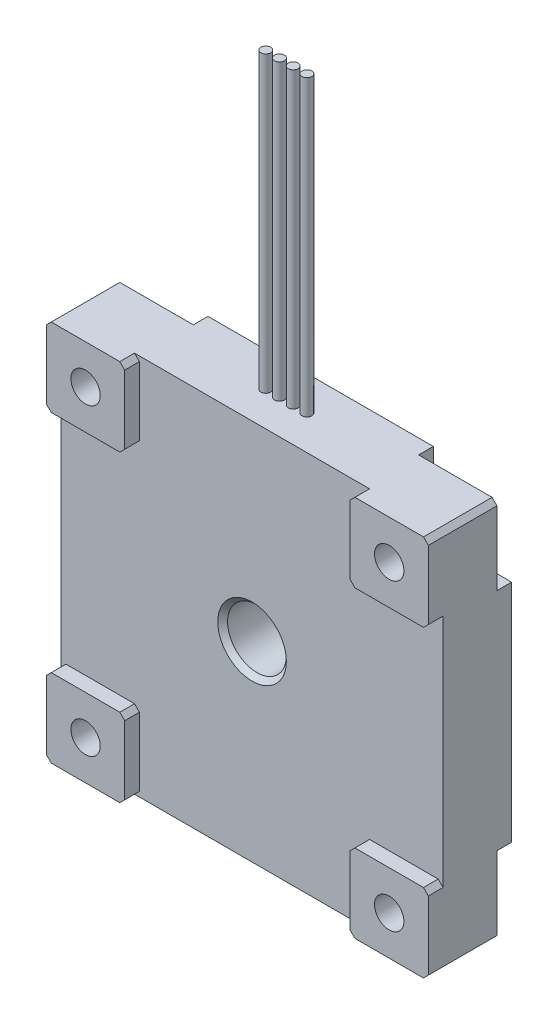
ISO-10303-21;
HEADER;
FILE_DESCRIPTION(('STEP AP214'),'2;1');
FILE_NAME('part.step','',(''),(''),'','','');
FILE_SCHEMA(('AUTOMOTIVE_DESIGN { 1 0 10303 214 1 1 1 1 }'));
ENDSEC;
DATA;
#1=APPLICATION_CONTEXT('core data for automotive mechanical design processes');
#2=APPLICATION_PROTOCOL_DEFINITION('international standard','automotive_design',2000,#1);
#3=PRODUCT_CONTEXT('',#1,'mechanical');
#4=PRODUCT('Part','Part','',(#3));
#5=PRODUCT_RELATED_PRODUCT_CATEGORY('part','',(#4));
#6=PRODUCT_DEFINITION_FORMATION('','',#4);
#7=PRODUCT_DEFINITION_CONTEXT('part definition',#1,'design');
#8=PRODUCT_DEFINITION('design','',#6,#7);
#9=PRODUCT_DEFINITION_SHAPE('','',#8);
#10=(LENGTH_UNIT() NAMED_UNIT(*) SI_UNIT(.MILLI.,.METRE.));
#11=(NAMED_UNIT(*) PLANE_ANGLE_UNIT() SI_UNIT($,.RADIAN.));
#12=(NAMED_UNIT(*) SI_UNIT($,.STERADIAN.) SOLID_ANGLE_UNIT());
#13=UNCERTAINTY_MEASURE_WITH_UNIT(LENGTH_MEASURE(1.E-05),#10,'distance_accuracy_value','');
#14=(GEOMETRIC_REPRESENTATION_CONTEXT(3) GLOBAL_UNCERTAINTY_ASSIGNED_CONTEXT((#13)) GLOBAL_UNIT_ASSIGNED_CONTEXT((#10,
#11,#12)) REPRESENTATION_CONTEXT('',''));
#15=CARTESIAN_POINT('',(0.,0.,0.));
#16=DIRECTION('',(0.,0.,1.));
#17=DIRECTION('',(1.,0.,0.));
#18=AXIS2_PLACEMENT_3D('',#15,#16,#17);
#19=CARTESIAN_POINT('',(19.5,19.5,8.5));
#20=DIRECTION('',(0.,-1.,0.));
#21=DIRECTION('',(1.,0.,0.));
#22=AXIS2_PLACEMENT_3D('',#19,#20,#21);
#23=PLANE('',#22);
#24=CARTESIAN_POINT('',(0.699999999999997,19.5,3.5));
#25=DIRECTION('',(0.,-1.,0.));
#26=DIRECTION('',(1.,0.,0.));
#27=AXIS2_PLACEMENT_3D('',#24,#25,#26);
#28=CIRCLE('',#27,0.5);
#29=CARTESIAN_POINT('',(1.2,19.5,3.5));
#30=VERTEX_POINT('',#29);
#31=EDGE_CURVE('E44',#30,#30,#28,.F.);
#32=ORIENTED_EDGE('',*,*,#31,.F.);
#33=EDGE_LOOP('',(#32));
#34=FACE_BOUND('',#33,.T.);
#35=CARTESIAN_POINT('',(-2.1,19.5,3.5));
#36=DIRECTION('',(0.,-1.,0.));
#37=DIRECTION('',(1.,0.,0.));
#38=AXIS2_PLACEMENT_3D('',#35,#36,#37);
#39=CIRCLE('',#38,0.5);
#40=CARTESIAN_POINT('',(-1.6,19.5,3.5));
#41=VERTEX_POINT('',#40);
#42=EDGE_CURVE('E687',#41,#41,#39,.F.);
#43=ORIENTED_EDGE('',*,*,#42,.F.);
#44=EDGE_LOOP('',(#43));
#45=FACE_BOUND('',#44,.T.);
#46=DIRECTION('',(-1.,0.,0.));
#47=VECTOR('',#46,1.);
#48=CARTESIAN_POINT('',(0.,19.5,7.));
#49=LINE('',#48,#47);
#50=CARTESIAN_POINT('',(12.,19.5,7.));
#51=VERTEX_POINT('',#50);
#52=CARTESIAN_POINT('',(-12.,19.5,7.));
#53=VERTEX_POINT('',#52);
#54=EDGE_CURVE('E457',#51,#53,#49,.T.);
#55=ORIENTED_EDGE('',*,*,#54,.F.);
#56=DIRECTION('',(0.,0.,1.));
#57=VECTOR('',#56,1.);
#58=CARTESIAN_POINT('',(12.,19.5,8.5));
#59=LINE('',#58,#57);
#60=CARTESIAN_POINT('',(12.,19.5,8.5));
#61=VERTEX_POINT('',#60);
#62=EDGE_CURVE('E630',#51,#61,#59,.T.);
#63=ORIENTED_EDGE('',*,*,#62,.T.);
#64=DIRECTION('',(-1.,0.,0.));
#65=VECTOR('',#64,1.);
#66=CARTESIAN_POINT('',(19.5,19.5,8.5));
#67=LINE('',#66,#65);
#68=CARTESIAN_POINT('',(19.,19.5,8.5));
#69=VERTEX_POINT('',#68);
#70=EDGE_CURVE('E512',#69,#61,#67,.T.);
#71=ORIENTED_EDGE('',*,*,#70,.F.);
#72=DIRECTION('',(0.,0.,-1.));
#73=VECTOR('',#72,1.);
#74=CARTESIAN_POINT('',(19.,19.5,8.5));
#75=LINE('',#74,#73);
#76=CARTESIAN_POINT('',(19.,19.5,1.5));
#77=VERTEX_POINT('',#76);
#78=EDGE_CURVE('E550',#69,#77,#75,.T.);
#79=ORIENTED_EDGE('',*,*,#78,.T.);
#80=DIRECTION('',(1.,0.,0.));
#81=VECTOR('',#80,1.);
#82=CARTESIAN_POINT('',(0.,19.5,1.5));
#83=LINE('',#82,#81);
#84=CARTESIAN_POINT('',(11.5,19.5,1.5));
#85=VERTEX_POINT('',#84);
#86=EDGE_CURVE('E412',#85,#77,#83,.T.);
#87=ORIENTED_EDGE('',*,*,#86,.F.);
#88=DIRECTION('',(0.,0.,-1.));
#89=VECTOR('',#88,1.);
#90=CARTESIAN_POINT('',(11.5,19.5,1.5));
#91=LINE('',#90,#89);
#92=CARTESIAN_POINT('',(11.5,19.5,0.));
#93=VERTEX_POINT('',#92);
#94=EDGE_CURVE('E429',#85,#93,#91,.T.);
#95=ORIENTED_EDGE('',*,*,#94,.T.);
#96=DIRECTION('',(-1.,0.,0.));
#97=VECTOR('',#96,1.);
#98=CARTESIAN_POINT('',(19.5,19.5,0.));
#99=LINE('',#98,#97);
#100=CARTESIAN_POINT('',(-11.5,19.5,0.));
#101=VERTEX_POINT('',#100);
#102=EDGE_CURVE('E521',#93,#101,#99,.T.);
#103=ORIENTED_EDGE('',*,*,#102,.T.);
#104=DIRECTION('',(0.,0.,-1.));
#105=VECTOR('',#104,1.);
#106=CARTESIAN_POINT('',(-11.5,19.5,1.5));
#107=LINE('',#106,#105);
#108=CARTESIAN_POINT('',(-11.5,19.5,1.5));
#109=VERTEX_POINT('',#108);
#110=EDGE_CURVE('E396',#109,#101,#107,.T.);
#111=ORIENTED_EDGE('',*,*,#110,.F.);
#112=DIRECTION('',(1.,0.,0.));
#113=VECTOR('',#112,1.);
#114=CARTESIAN_POINT('',(0.,19.5,1.5));
#115=LINE('',#114,#113);
#116=CARTESIAN_POINT('',(-19.,19.5,1.5));
#117=VERTEX_POINT('',#116);
#118=EDGE_CURVE('E385',#117,#109,#115,.T.);
#119=ORIENTED_EDGE('',*,*,#118,.F.);
#120=DIRECTION('',(0.,0.,1.));
#121=VECTOR('',#120,1.);
#122=CARTESIAN_POINT('',(-19.,19.5,8.5));
#123=LINE('',#122,#121);
#124=CARTESIAN_POINT('',(-19.,19.5,8.5));
#125=VERTEX_POINT('',#124);
#126=EDGE_CURVE('E547',#117,#125,#123,.T.);
#127=ORIENTED_EDGE('',*,*,#126,.T.);
#128=CARTESIAN_POINT('',(-12.,19.5,8.5));
#129=VERTEX_POINT('',#128);
#130=EDGE_CURVE('E511',#129,#125,#67,.T.);
#131=ORIENTED_EDGE('',*,*,#130,.F.);
#132=DIRECTION('',(0.,0.,-1.));
#133=VECTOR('',#132,1.);
#134=CARTESIAN_POINT('',(-12.,19.5,7.));
#135=LINE('',#134,#133);
#136=EDGE_CURVE('E627',#129,#53,#135,.T.);
#137=ORIENTED_EDGE('',*,*,#136,.T.);
#138=EDGE_LOOP('',(#55,#63,#71,#79,#87,#95,#103,#111,#119,#127,#131,#137));
#139=FACE_BOUND('',#138,.T.);
#140=CARTESIAN_POINT('',(-0.700000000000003,19.5,3.5));
#141=DIRECTION('',(0.,-1.,0.));
#142=DIRECTION('',(1.,0.,0.));
#143=AXIS2_PLACEMENT_3D('',#140,#141,#142);
#144=CIRCLE('',#143,0.5);
#145=CARTESIAN_POINT('',(-0.200000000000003,19.5,3.5));
#146=VERTEX_POINT('',#145);
#147=EDGE_CURVE('E690',#146,#146,#144,.F.);
#148=ORIENTED_EDGE('',*,*,#147,.F.);
#149=EDGE_LOOP('',(#148));
#150=FACE_BOUND('',#149,.T.);
#151=CARTESIAN_POINT('',(2.1,19.5,3.5));
#152=DIRECTION('',(0.,-1.,0.));
#153=DIRECTION('',(1.,0.,0.));
#154=AXIS2_PLACEMENT_3D('',#151,#152,#153);
#155=CIRCLE('',#154,0.5);
#156=CARTESIAN_POINT('',(2.6,19.5,3.5));
#157=VERTEX_POINT('',#156);
#158=EDGE_CURVE('E12',#157,#157,#155,.F.);
#159=ORIENTED_EDGE('',*,*,#158,.F.);
#160=EDGE_LOOP('',(#159));
#161=FACE_BOUND('',#160,.T.);
#162=ADVANCED_FACE('F36',(#34,#45,#139,#150,#161),#23,.F.);
#163=CARTESIAN_POINT('',(0.,0.,0.));
#164=DIRECTION('',(0.,0.,1.));
#165=DIRECTION('',(1.,0.,0.));
#166=AXIS2_PLACEMENT_3D('',#163,#164,#165);
#167=PLANE('',#166);
#168=CARTESIAN_POINT('',(0.,0.,0.));
#169=DIRECTION('',(0.,0.,1.));
#170=DIRECTION('',(1.,0.,0.));
#171=AXIS2_PLACEMENT_3D('',#168,#169,#170);
#172=CIRCLE('',#171,3.5);
#173=CARTESIAN_POINT('',(3.5,0.,0.));
#174=VERTEX_POINT('',#173);
#175=EDGE_CURVE('E684',#174,#174,#172,.T.);
#176=ORIENTED_EDGE('',*,*,#175,.T.);
#177=EDGE_LOOP('',(#176));
#178=FACE_BOUND('',#177,.T.);
#179=DIRECTION('',(0.,1.,0.));
#180=VECTOR('',#179,1.);
#181=CARTESIAN_POINT('',(-11.5,0.,0.));
#182=LINE('',#181,#180);
#183=CARTESIAN_POINT('',(-11.5,-19.5,0.));
#184=VERTEX_POINT('',#183);
#185=CARTESIAN_POINT('',(-11.5,-11.5,0.));
#186=VERTEX_POINT('',#185);
#187=EDGE_CURVE('E1044',#184,#186,#182,.T.);
#188=ORIENTED_EDGE('',*,*,#187,.T.);
#189=DIRECTION('',(-1.,0.,0.));
#190=VECTOR('',#189,1.);
#191=CARTESIAN_POINT('',(0.,-11.5,0.));
#192=LINE('',#191,#190);
#193=CARTESIAN_POINT('',(-19.5,-11.5,0.));
#194=VERTEX_POINT('',#193);
#195=EDGE_CURVE('E1038',#186,#194,#192,.T.);
#196=ORIENTED_EDGE('',*,*,#195,.T.);
#197=DIRECTION('',(0.,-1.,0.));
#198=VECTOR('',#197,1.);
#199=CARTESIAN_POINT('',(-19.5,-19.5,0.));
#200=LINE('',#199,#198);
#201=CARTESIAN_POINT('',(-19.5,11.5,0.));
#202=VERTEX_POINT('',#201);
#203=EDGE_CURVE('E346',#202,#194,#200,.T.);
#204=ORIENTED_EDGE('',*,*,#203,.F.);
#205=DIRECTION('',(-1.,0.,0.));
#206=VECTOR('',#205,1.);
#207=CARTESIAN_POINT('',(0.,11.5,0.));
#208=LINE('',#207,#206);
#209=CARTESIAN_POINT('',(-11.5,11.5,0.));
#210=VERTEX_POINT('',#209);
#211=EDGE_CURVE('E386',#210,#202,#208,.T.);
#212=ORIENTED_EDGE('',*,*,#211,.F.);
#213=DIRECTION('',(0.,-1.,0.));
#214=VECTOR('',#213,1.);
#215=CARTESIAN_POINT('',(-11.5,0.,0.));
#216=LINE('',#215,#214);
#217=EDGE_CURVE('E377',#101,#210,#216,.T.);
#218=ORIENTED_EDGE('',*,*,#217,.F.);
#219=ORIENTED_EDGE('',*,*,#102,.F.);
#220=DIRECTION('',(0.,-1.,0.));
#221=VECTOR('',#220,1.);
#222=CARTESIAN_POINT('',(11.5,0.,0.));
#223=LINE('',#222,#221);
#224=CARTESIAN_POINT('',(11.5,11.5,0.));
#225=VERTEX_POINT('',#224);
#226=EDGE_CURVE('E410',#93,#225,#223,.T.);
#227=ORIENTED_EDGE('',*,*,#226,.T.);
#228=DIRECTION('',(1.,0.,0.));
#229=VECTOR('',#228,1.);
#230=CARTESIAN_POINT('',(0.,11.5,0.));
#231=LINE('',#230,#229);
#232=CARTESIAN_POINT('',(19.5,11.5,0.));
#233=VERTEX_POINT('',#232);
#234=EDGE_CURVE('E402',#225,#233,#231,.T.);
#235=ORIENTED_EDGE('',*,*,#234,.T.);
#236=DIRECTION('',(0.,1.,0.));
#237=VECTOR('',#236,1.);
#238=CARTESIAN_POINT('',(19.5,-19.5,0.));
#239=LINE('',#238,#237);
#240=CARTESIAN_POINT('',(19.5,-11.5,0.));
#241=VERTEX_POINT('',#240);
#242=EDGE_CURVE('E519',#241,#233,#239,.T.);
#243=ORIENTED_EDGE('',*,*,#242,.F.);
#244=DIRECTION('',(1.,0.,0.));
#245=VECTOR('',#244,1.);
#246=CARTESIAN_POINT('',(0.,-11.5,0.));
#247=LINE('',#246,#245);
#248=CARTESIAN_POINT('',(11.5,-11.5,0.));
#249=VERTEX_POINT('',#248);
#250=EDGE_CURVE('E359',#249,#241,#247,.T.);
#251=ORIENTED_EDGE('',*,*,#250,.F.);
#252=DIRECTION('',(0.,1.,0.));
#253=VECTOR('',#252,1.);
#254=CARTESIAN_POINT('',(11.5,0.,0.));
#255=LINE('',#254,#253);
#256=CARTESIAN_POINT('',(11.5,-19.5,0.));
#257=VERTEX_POINT('',#256);
#258=EDGE_CURVE('E349',#257,#249,#255,.T.);
#259=ORIENTED_EDGE('',*,*,#258,.F.);
#260=DIRECTION('',(1.,0.,0.));
#261=VECTOR('',#260,1.);
#262=CARTESIAN_POINT('',(19.5,-19.5,0.));
#263=LINE('',#262,#261);
#264=EDGE_CURVE('E517',#184,#257,#263,.T.);
#265=ORIENTED_EDGE('',*,*,#264,.F.);
#266=EDGE_LOOP('',(#188,#196,#204,#212,#218,#219,#227,#235,#243,#251,#259,#265));
#267=FACE_BOUND('',#266,.T.);
#268=ADVANCED_FACE('F699',(#178,#267),#167,.F.);
#269=CARTESIAN_POINT('',(0.,0.,7.));
#270=DIRECTION('',(0.,0.,1.));
#271=DIRECTION('',(1.,0.,0.));
#272=AXIS2_PLACEMENT_3D('',#269,#270,#271);
#273=PLANE('',#272);
#274=CARTESIAN_POINT('',(0.,0.,7.));
#275=DIRECTION('',(0.,0.,1.));
#276=DIRECTION('',(1.,0.,0.));
#277=AXIS2_PLACEMENT_3D('',#274,#275,#276);
#278=CIRCLE('',#277,3.5);
#279=CARTESIAN_POINT('',(3.5,0.,7.));
#280=VERTEX_POINT('',#279);
#281=EDGE_CURVE('E681',#280,#280,#278,.F.);
#282=ORIENTED_EDGE('',*,*,#281,.T.);
#283=EDGE_LOOP('',(#282));
#284=FACE_BOUND('',#283,.T.);
#285=DIRECTION('',(-1.,0.,0.));
#286=VECTOR('',#285,1.);
#287=CARTESIAN_POINT('',(0.,-11.5,7.));
#288=LINE('',#287,#286);
#289=CARTESIAN_POINT('',(-12.,-11.5,7.));
#290=VERTEX_POINT('',#289);
#291=CARTESIAN_POINT('',(-19.,-11.5,7.));
#292=VERTEX_POINT('',#291);
#293=EDGE_CURVE('E434',#290,#292,#288,.T.);
#294=ORIENTED_EDGE('',*,*,#293,.F.);
#295=DIRECTION('',(0.707106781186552,-0.707106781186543,0.));
#296=VECTOR('',#295,1.);
#297=CARTESIAN_POINT('',(-11.5,-12.,7.));
#298=LINE('',#297,#296);
#299=CARTESIAN_POINT('',(-11.5,-12.,7.));
#300=VERTEX_POINT('',#299);
#301=EDGE_CURVE('E657',#290,#300,#298,.T.);
#302=ORIENTED_EDGE('',*,*,#301,.T.);
#303=DIRECTION('',(0.,-1.,0.));
#304=VECTOR('',#303,1.);
#305=CARTESIAN_POINT('',(-11.5,0.,7.));
#306=LINE('',#305,#304);
#307=CARTESIAN_POINT('',(-11.5,-19.,7.));
#308=VERTEX_POINT('',#307);
#309=EDGE_CURVE('E437',#300,#308,#306,.T.);
#310=ORIENTED_EDGE('',*,*,#309,.T.);
#311=DIRECTION('',(0.70710678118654,0.707106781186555,0.));
#312=VECTOR('',#311,1.);
#313=CARTESIAN_POINT('',(-12.,-19.5,7.));
#314=LINE('',#313,#312);
#315=CARTESIAN_POINT('',(-12.,-19.5,7.));
#316=VERTEX_POINT('',#315);
#317=EDGE_CURVE('E659',#308,#316,#314,.F.);
#318=ORIENTED_EDGE('',*,*,#317,.T.);
#319=DIRECTION('',(1.,0.,0.));
#320=VECTOR('',#319,1.);
#321=CARTESIAN_POINT('',(0.,-19.5,7.));
#322=LINE('',#321,#320);
#323=CARTESIAN_POINT('',(12.,-19.5,7.));
#324=VERTEX_POINT('',#323);
#325=EDGE_CURVE('E441',#316,#324,#322,.T.);
#326=ORIENTED_EDGE('',*,*,#325,.T.);
#327=DIRECTION('',(-0.707106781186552,0.707106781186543,0.));
#328=VECTOR('',#327,1.);
#329=CARTESIAN_POINT('',(11.5,-19.,7.));
#330=LINE('',#329,#328);
#331=CARTESIAN_POINT('',(11.5,-19.,7.));
#332=VERTEX_POINT('',#331);
#333=EDGE_CURVE('E648',#324,#332,#330,.T.);
#334=ORIENTED_EDGE('',*,*,#333,.T.);
#335=DIRECTION('',(0.,-1.,0.));
#336=VECTOR('',#335,1.);
#337=CARTESIAN_POINT('',(11.5,0.,7.));
#338=LINE('',#337,#336);
#339=CARTESIAN_POINT('',(11.5,-12.,7.));
#340=VERTEX_POINT('',#339);
#341=EDGE_CURVE('E443',#340,#332,#338,.T.);
#342=ORIENTED_EDGE('',*,*,#341,.F.);
#343=DIRECTION('',(0.707106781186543,0.707106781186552,0.));
#344=VECTOR('',#343,1.);
#345=CARTESIAN_POINT('',(12.,-11.5,7.));
#346=LINE('',#345,#344);
#347=CARTESIAN_POINT('',(12.,-11.5,7.));
#348=VERTEX_POINT('',#347);
#349=EDGE_CURVE('E650',#340,#348,#346,.T.);
#350=ORIENTED_EDGE('',*,*,#349,.T.);
#351=DIRECTION('',(1.,0.,0.));
#352=VECTOR('',#351,1.);
#353=CARTESIAN_POINT('',(0.,-11.5,7.));
#354=LINE('',#353,#352);
#355=CARTESIAN_POINT('',(19.,-11.5,7.));
#356=VERTEX_POINT('',#355);
#357=EDGE_CURVE('E446',#348,#356,#354,.T.);
#358=ORIENTED_EDGE('',*,*,#357,.T.);
#359=DIRECTION('',(-0.707106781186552,0.707106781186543,0.));
#360=VECTOR('',#359,1.);
#361=CARTESIAN_POINT('',(19.5,-12.,7.));
#362=LINE('',#361,#360);
#363=CARTESIAN_POINT('',(19.5,-12.,7.));
#364=VERTEX_POINT('',#363);
#365=EDGE_CURVE('E652',#356,#364,#362,.F.);
#366=ORIENTED_EDGE('',*,*,#365,.T.);
#367=DIRECTION('',(0.,1.,0.));
#368=VECTOR('',#367,1.);
#369=CARTESIAN_POINT('',(19.5,0.,7.));
#370=LINE('',#369,#368);
#371=CARTESIAN_POINT('',(19.5,12.,7.));
#372=VERTEX_POINT('',#371);
#373=EDGE_CURVE('E449',#364,#372,#370,.T.);
#374=ORIENTED_EDGE('',*,*,#373,.T.);
#375=DIRECTION('',(-0.707106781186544,-0.707106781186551,0.));
#376=VECTOR('',#375,1.);
#377=CARTESIAN_POINT('',(19.,11.5,7.));
#378=LINE('',#377,#376);
#379=CARTESIAN_POINT('',(19.,11.5,7.));
#380=VERTEX_POINT('',#379);
#381=EDGE_CURVE('E662',#372,#380,#378,.T.);
#382=ORIENTED_EDGE('',*,*,#381,.T.);
#383=DIRECTION('',(1.,0.,0.));
#384=VECTOR('',#383,1.);
#385=CARTESIAN_POINT('',(0.,11.5,7.));
#386=LINE('',#385,#384);
#387=CARTESIAN_POINT('',(12.,11.5,7.));
#388=VERTEX_POINT('',#387);
#389=EDGE_CURVE('E451',#388,#380,#386,.T.);
#390=ORIENTED_EDGE('',*,*,#389,.F.);
#391=DIRECTION('',(-0.707106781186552,0.707106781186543,0.));
#392=VECTOR('',#391,1.);
#393=CARTESIAN_POINT('',(11.5,12.,7.));
#394=LINE('',#393,#392);
#395=CARTESIAN_POINT('',(11.5,12.,7.));
#396=VERTEX_POINT('',#395);
#397=EDGE_CURVE('E664',#388,#396,#394,.T.);
#398=ORIENTED_EDGE('',*,*,#397,.T.);
#399=DIRECTION('',(0.,1.,0.));
#400=VECTOR('',#399,1.);
#401=CARTESIAN_POINT('',(11.5,0.,7.));
#402=LINE('',#401,#400);
#403=CARTESIAN_POINT('',(11.5,19.,7.));
#404=VERTEX_POINT('',#403);
#405=EDGE_CURVE('E454',#396,#404,#402,.T.);
#406=ORIENTED_EDGE('',*,*,#405,.T.);
#407=DIRECTION('',(-0.707106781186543,-0.707106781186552,0.));
#408=VECTOR('',#407,1.);
#409=CARTESIAN_POINT('',(12.,19.5,7.));
#410=LINE('',#409,#408);
#411=EDGE_CURVE('E666',#404,#51,#410,.F.);
#412=ORIENTED_EDGE('',*,*,#411,.T.);
#413=ORIENTED_EDGE('',*,*,#54,.T.);
#414=DIRECTION('',(0.707106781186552,-0.707106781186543,0.));
#415=VECTOR('',#414,1.);
#416=CARTESIAN_POINT('',(-11.5,19.,7.));
#417=LINE('',#416,#415);
#418=CARTESIAN_POINT('',(-11.5,19.,7.));
#419=VERTEX_POINT('',#418);
#420=EDGE_CURVE('E669',#53,#419,#417,.T.);
#421=ORIENTED_EDGE('',*,*,#420,.T.);
#422=DIRECTION('',(0.,1.,0.));
#423=VECTOR('',#422,1.);
#424=CARTESIAN_POINT('',(-11.5,0.,7.));
#425=LINE('',#424,#423);
#426=CARTESIAN_POINT('',(-11.5,12.,7.));
#427=VERTEX_POINT('',#426);
#428=EDGE_CURVE('E459',#427,#419,#425,.T.);
#429=ORIENTED_EDGE('',*,*,#428,.F.);
#430=DIRECTION('',(-0.707106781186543,-0.707106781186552,0.));
#431=VECTOR('',#430,1.);
#432=CARTESIAN_POINT('',(-12.,11.5,7.));
#433=LINE('',#432,#431);
#434=CARTESIAN_POINT('',(-12.,11.5,7.));
#435=VERTEX_POINT('',#434);
#436=EDGE_CURVE('E58',#427,#435,#433,.T.);
#437=ORIENTED_EDGE('',*,*,#436,.T.);
#438=DIRECTION('',(-1.,0.,0.));
#439=VECTOR('',#438,1.);
#440=CARTESIAN_POINT('',(0.,11.5,7.));
#441=LINE('',#440,#439);
#442=CARTESIAN_POINT('',(-19.,11.5,7.));
#443=VERTEX_POINT('',#442);
#444=EDGE_CURVE('E462',#435,#443,#441,.T.);
#445=ORIENTED_EDGE('',*,*,#444,.T.);
#446=DIRECTION('',(0.707106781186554,-0.707106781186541,0.));
#447=VECTOR('',#446,1.);
#448=CARTESIAN_POINT('',(-19.5,12.,7.));
#449=LINE('',#448,#447);
#450=CARTESIAN_POINT('',(-19.5,12.,7.));
#451=VERTEX_POINT('',#450);
#452=EDGE_CURVE('E671',#443,#451,#449,.F.);
#453=ORIENTED_EDGE('',*,*,#452,.T.);
#454=DIRECTION('',(0.,-1.,0.));
#455=VECTOR('',#454,1.);
#456=CARTESIAN_POINT('',(-19.5,0.,7.));
#457=LINE('',#456,#455);
#458=CARTESIAN_POINT('',(-19.5,-12.,7.));
#459=VERTEX_POINT('',#458);
#460=EDGE_CURVE('E464',#451,#459,#457,.T.);
#461=ORIENTED_EDGE('',*,*,#460,.T.);
#462=DIRECTION('',(0.707106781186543,0.707106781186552,0.));
#463=VECTOR('',#462,1.);
#464=CARTESIAN_POINT('',(-19.,-11.5,7.));
#465=LINE('',#464,#463);
#466=EDGE_CURVE('E655',#459,#292,#465,.T.);
#467=ORIENTED_EDGE('',*,*,#466,.T.);
#468=EDGE_LOOP('',(#294,#302,#310,#318,#326,#334,#342,#350,#358,#366,#374,#382,#390,#398,#406,
#412,#413,#421,#429,#437,#445,#453,#461,#467));
#469=FACE_BOUND('',#468,.T.);
#470=ADVANCED_FACE('F795',(#284,#469),#273,.T.);
#471=CARTESIAN_POINT('',(-19.5,-19.5,8.5));
#472=DIRECTION('',(1.,0.,0.));
#473=DIRECTION('',(0.,0.,-1.));
#474=AXIS2_PLACEMENT_3D('',#471,#472,#473);
#475=PLANE('',#474);
#476=DIRECTION('',(0.,-1.,0.));
#477=VECTOR('',#476,1.);
#478=CARTESIAN_POINT('',(-19.5,-19.5,8.5));
#479=LINE('',#478,#477);
#480=CARTESIAN_POINT('',(-19.5,-12.,8.5));
#481=VERTEX_POINT('',#480);
#482=CARTESIAN_POINT('',(-19.5,-19.,8.5));
#483=VERTEX_POINT('',#482);
#484=EDGE_CURVE('E503',#481,#483,#479,.T.);
#485=ORIENTED_EDGE('',*,*,#484,.F.);
#486=DIRECTION('',(0.,0.,-1.));
#487=VECTOR('',#486,1.);
#488=CARTESIAN_POINT('',(-19.5,-12.,7.));
#489=LINE('',#488,#487);
#490=EDGE_CURVE('E603',#481,#459,#489,.T.);
#491=ORIENTED_EDGE('',*,*,#490,.T.);
#492=ORIENTED_EDGE('',*,*,#460,.F.);
#493=DIRECTION('',(0.,0.,1.));
#494=VECTOR('',#493,1.);
#495=CARTESIAN_POINT('',(-19.5,12.,8.5));
#496=LINE('',#495,#494);
#497=CARTESIAN_POINT('',(-19.5,12.,8.5));
#498=VERTEX_POINT('',#497);
#499=EDGE_CURVE('E600',#451,#498,#496,.T.);
#500=ORIENTED_EDGE('',*,*,#499,.T.);
#501=CARTESIAN_POINT('',(-19.5,19.,8.5));
#502=VERTEX_POINT('',#501);
#503=EDGE_CURVE('E499',#502,#498,#479,.T.);
#504=ORIENTED_EDGE('',*,*,#503,.F.);
#505=DIRECTION('',(0.,0.,-1.));
#506=VECTOR('',#505,1.);
#507=CARTESIAN_POINT('',(-19.5,19.,8.5));
#508=LINE('',#507,#506);
#509=CARTESIAN_POINT('',(-19.5,19.,1.5));
#510=VERTEX_POINT('',#509);
#511=EDGE_CURVE('E530',#502,#510,#508,.T.);
#512=ORIENTED_EDGE('',*,*,#511,.T.);
#513=DIRECTION('',(0.,1.,0.));
#514=VECTOR('',#513,1.);
#515=CARTESIAN_POINT('',(-19.5,0.,1.5));
#516=LINE('',#515,#514);
#517=CARTESIAN_POINT('',(-19.5,11.5,1.5));
#518=VERTEX_POINT('',#517);
#519=EDGE_CURVE('E393',#518,#510,#516,.T.);
#520=ORIENTED_EDGE('',*,*,#519,.F.);
#521=DIRECTION('',(0.,0.,-1.));
#522=VECTOR('',#521,1.);
#523=CARTESIAN_POINT('',(-19.5,11.5,1.5));
#524=LINE('',#523,#522);
#525=EDGE_CURVE('E400',#518,#202,#524,.T.);
#526=ORIENTED_EDGE('',*,*,#525,.T.);
#527=ORIENTED_EDGE('',*,*,#203,.T.);
#528=DIRECTION('',(0.,0.,-1.));
#529=VECTOR('',#528,1.);
#530=CARTESIAN_POINT('',(-19.5,-11.5,1.5));
#531=LINE('',#530,#529);
#532=CARTESIAN_POINT('',(-19.5,-11.5,1.5));
#533=VERTEX_POINT('',#532);
#534=EDGE_CURVE('E335',#533,#194,#531,.T.);
#535=ORIENTED_EDGE('',*,*,#534,.F.);
#536=DIRECTION('',(0.,1.,0.));
#537=VECTOR('',#536,1.);
#538=CARTESIAN_POINT('',(-19.5,0.,1.5));
#539=LINE('',#538,#537);
#540=CARTESIAN_POINT('',(-19.5,-19.,1.5));
#541=VERTEX_POINT('',#540);
#542=EDGE_CURVE('E318',#541,#533,#539,.T.);
#543=ORIENTED_EDGE('',*,*,#542,.F.);
#544=DIRECTION('',(0.,0.,1.));
#545=VECTOR('',#544,1.);
#546=CARTESIAN_POINT('',(-19.5,-19.,8.5));
#547=LINE('',#546,#545);
#548=EDGE_CURVE('E533',#541,#483,#547,.T.);
#549=ORIENTED_EDGE('',*,*,#548,.T.);
#550=EDGE_LOOP('',(#485,#491,#492,#500,#504,#512,#520,#526,#527,#535,#543,#549));
#551=FACE_BOUND('',#550,.T.);
#552=ADVANCED_FACE('F343',(#551),#475,.F.);
#553=CARTESIAN_POINT('',(19.5,-19.5,8.5));
#554=DIRECTION('',(0.,1.,0.));
#555=DIRECTION('',(-1.,0.,0.));
#556=AXIS2_PLACEMENT_3D('',#553,#554,#555);
#557=PLANE('',#556);
#558=DIRECTION('',(1.,0.,0.));
#559=VECTOR('',#558,1.);
#560=CARTESIAN_POINT('',(19.5,-19.5,8.5));
#561=LINE('',#560,#559);
#562=CARTESIAN_POINT('',(12.,-19.5,8.5));
#563=VERTEX_POINT('',#562);
#564=CARTESIAN_POINT('',(19.,-19.5,8.5));
#565=VERTEX_POINT('',#564);
#566=EDGE_CURVE('E502',#563,#565,#561,.T.);
#567=ORIENTED_EDGE('',*,*,#566,.F.);
#568=DIRECTION('',(0.,0.,-1.));
#569=VECTOR('',#568,1.);
#570=CARTESIAN_POINT('',(12.,-19.5,7.));
#571=LINE('',#570,#569);
#572=EDGE_CURVE('E575',#563,#324,#571,.T.);
#573=ORIENTED_EDGE('',*,*,#572,.T.);
#574=ORIENTED_EDGE('',*,*,#325,.F.);
#575=DIRECTION('',(0.,0.,1.));
#576=VECTOR('',#575,1.);
#577=CARTESIAN_POINT('',(-12.,-19.5,8.5));
#578=LINE('',#577,#576);
#579=CARTESIAN_POINT('',(-12.,-19.5,8.5));
#580=VERTEX_POINT('',#579);
#581=EDGE_CURVE('E572',#316,#580,#578,.T.);
#582=ORIENTED_EDGE('',*,*,#581,.T.);
#583=CARTESIAN_POINT('',(-19.,-19.5,8.5));
#584=VERTEX_POINT('',#583);
#585=EDGE_CURVE('E504',#584,#580,#561,.T.);
#586=ORIENTED_EDGE('',*,*,#585,.F.);
#587=DIRECTION('',(0.,0.,-1.));
#588=VECTOR('',#587,1.);
#589=CARTESIAN_POINT('',(-19.,-19.5,8.5));
#590=LINE('',#589,#588);
#591=CARTESIAN_POINT('',(-19.,-19.5,1.5));
#592=VERTEX_POINT('',#591);
#593=EDGE_CURVE('E526',#584,#592,#590,.T.);
#594=ORIENTED_EDGE('',*,*,#593,.T.);
#595=DIRECTION('',(-1.,0.,0.));
#596=VECTOR('',#595,1.);
#597=CARTESIAN_POINT('',(0.,-19.5,1.5));
#598=LINE('',#597,#596);
#599=CARTESIAN_POINT('',(-11.5,-19.5,1.5));
#600=VERTEX_POINT('',#599);
#601=EDGE_CURVE('E330',#600,#592,#598,.T.);
#602=ORIENTED_EDGE('',*,*,#601,.F.);
#603=DIRECTION('',(0.,0.,-1.));
#604=VECTOR('',#603,1.);
#605=CARTESIAN_POINT('',(-11.5,-19.5,1.5));
#606=LINE('',#605,#604);
#607=EDGE_CURVE('E347',#600,#184,#606,.T.);
#608=ORIENTED_EDGE('',*,*,#607,.T.);
#609=ORIENTED_EDGE('',*,*,#264,.T.);
#610=DIRECTION('',(0.,0.,-1.));
#611=VECTOR('',#610,1.);
#612=CARTESIAN_POINT('',(11.5,-19.5,1.5));
#613=LINE('',#612,#611);
#614=CARTESIAN_POINT('',(11.5,-19.5,1.5));
#615=VERTEX_POINT('',#614);
#616=EDGE_CURVE('E370',#615,#257,#613,.T.);
#617=ORIENTED_EDGE('',*,*,#616,.F.);
#618=DIRECTION('',(-1.,0.,0.));
#619=VECTOR('',#618,1.);
#620=CARTESIAN_POINT('',(0.,-19.5,1.5));
#621=LINE('',#620,#619);
#622=CARTESIAN_POINT('',(19.,-19.5,1.5));
#623=VERTEX_POINT('',#622);
#624=EDGE_CURVE('E358',#623,#615,#621,.T.);
#625=ORIENTED_EDGE('',*,*,#624,.F.);
#626=DIRECTION('',(0.,0.,1.));
#627=VECTOR('',#626,1.);
#628=CARTESIAN_POINT('',(19.,-19.5,8.5));
#629=LINE('',#628,#627);
#630=EDGE_CURVE('E515',#623,#565,#629,.T.);
#631=ORIENTED_EDGE('',*,*,#630,.T.);
#632=EDGE_LOOP('',(#567,#573,#574,#582,#586,#594,#602,#608,#609,#617,#625,#631));
#633=FACE_BOUND('',#632,.T.);
#634=ADVANCED_FACE('F834',(#633),#557,.F.);
#635=CARTESIAN_POINT('',(-15.5,-15.5,0.));
#636=DIRECTION('',(0.,0.,1.));
#637=DIRECTION('',(1.,0.,0.));
#638=AXIS2_PLACEMENT_3D('',#635,#636,#637);
#639=CYLINDRICAL_SURFACE('',#638,1.5);
#640=CARTESIAN_POINT('',(-15.5,-15.5,8.5));
#641=DIRECTION('',(0.,0.,1.));
#642=DIRECTION('',(-1.,0.,0.));
#643=AXIS2_PLACEMENT_3D('',#640,#641,#642);
#644=CIRCLE('',#643,1.5);
#645=CARTESIAN_POINT('',(-17.,-15.5,8.5));
#646=VERTEX_POINT('',#645);
#647=EDGE_CURVE('E466',#646,#646,#644,.T.);
#648=ORIENTED_EDGE('',*,*,#647,.T.);
#649=EDGE_LOOP('',(#648));
#650=FACE_BOUND('',#649,.T.);
#651=CARTESIAN_POINT('',(-15.5,-15.5,1.5));
#652=DIRECTION('',(0.,0.,-1.));
#653=DIRECTION('',(-1.,0.,0.));
#654=AXIS2_PLACEMENT_3D('',#651,#652,#653);
#655=CIRCLE('',#654,1.5);
#656=CARTESIAN_POINT('',(-17.,-15.5,1.5));
#657=VERTEX_POINT('',#656);
#658=EDGE_CURVE('E339',#657,#657,#655,.F.);
#659=ORIENTED_EDGE('',*,*,#658,.F.);
#660=EDGE_LOOP('',(#659));
#661=FACE_BOUND('',#660,.T.);
#662=ADVANCED_FACE('F830',(#650,#661),#639,.F.);
#663=CARTESIAN_POINT('',(15.5,-15.5,0.));
#664=DIRECTION('',(0.,0.,1.));
#665=DIRECTION('',(1.,0.,0.));
#666=AXIS2_PLACEMENT_3D('',#663,#664,#665);
#667=CYLINDRICAL_SURFACE('',#666,1.5);
#668=CARTESIAN_POINT('',(15.5,-15.5,8.5));
#669=DIRECTION('',(0.,0.,1.));
#670=DIRECTION('',(1.,0.,0.));
#671=AXIS2_PLACEMENT_3D('',#668,#669,#670);
#672=CIRCLE('',#671,1.5);
#673=CARTESIAN_POINT('',(17.,-15.5,8.5));
#674=VERTEX_POINT('',#673);
#675=EDGE_CURVE('E490',#674,#674,#672,.T.);
#676=ORIENTED_EDGE('',*,*,#675,.T.);
#677=EDGE_LOOP('',(#676));
#678=FACE_BOUND('',#677,.T.);
#679=CARTESIAN_POINT('',(15.5,-15.5,1.5));
#680=DIRECTION('',(0.,0.,-1.));
#681=DIRECTION('',(-1.,0.,0.));
#682=AXIS2_PLACEMENT_3D('',#679,#680,#681);
#683=CIRCLE('',#682,1.5);
#684=CARTESIAN_POINT('',(14.,-15.5,1.5));
#685=VERTEX_POINT('',#684);
#686=EDGE_CURVE('E355',#685,#685,#683,.F.);
#687=ORIENTED_EDGE('',*,*,#686,.F.);
#688=EDGE_LOOP('',(#687));
#689=FACE_BOUND('',#688,.T.);
#690=ADVANCED_FACE('F833',(#678,#689),#667,.F.);
#691=CARTESIAN_POINT('',(-15.5,15.5,0.));
#692=DIRECTION('',(0.,0.,1.));
#693=DIRECTION('',(1.,0.,0.));
#694=AXIS2_PLACEMENT_3D('',#691,#692,#693);
#695=CYLINDRICAL_SURFACE('',#694,1.5);
#696=CARTESIAN_POINT('',(-15.5,15.5,8.5));
#697=DIRECTION('',(0.,0.,1.));
#698=DIRECTION('',(1.,0.,0.));
#699=AXIS2_PLACEMENT_3D('',#696,#697,#698);
#700=CIRCLE('',#699,1.5);
#701=CARTESIAN_POINT('',(-14.,15.5,8.5));
#702=VERTEX_POINT('',#701);
#703=EDGE_CURVE('E496',#702,#702,#700,.T.);
#704=ORIENTED_EDGE('',*,*,#703,.T.);
#705=EDGE_LOOP('',(#704));
#706=FACE_BOUND('',#705,.T.);
#707=CARTESIAN_POINT('',(-15.5,15.5,1.5));
#708=DIRECTION('',(0.,0.,-1.));
#709=DIRECTION('',(-1.,0.,0.));
#710=AXIS2_PLACEMENT_3D('',#707,#708,#709);
#711=CIRCLE('',#710,1.5);
#712=CARTESIAN_POINT('',(-17.,15.5,1.5));
#713=VERTEX_POINT('',#712);
#714=EDGE_CURVE('E382',#713,#713,#711,.F.);
#715=ORIENTED_EDGE('',*,*,#714,.F.);
#716=EDGE_LOOP('',(#715));
#717=FACE_BOUND('',#716,.T.);
#718=ADVANCED_FACE('F838',(#706,#717),#695,.F.);
#719=CARTESIAN_POINT('',(19.5,-19.5,8.5));
#720=DIRECTION('',(-1.,0.,0.));
#721=DIRECTION('',(0.,0.,1.));
#722=AXIS2_PLACEMENT_3D('',#719,#720,#721);
#723=PLANE('',#722);
#724=ORIENTED_EDGE('',*,*,#373,.F.);
#725=DIRECTION('',(0.,0.,1.));
#726=VECTOR('',#725,1.);
#727=CARTESIAN_POINT('',(19.5,-12.,8.5));
#728=LINE('',#727,#726);
#729=CARTESIAN_POINT('',(19.5,-12.,8.5));
#730=VERTEX_POINT('',#729);
#731=EDGE_CURVE('E586',#364,#730,#728,.T.);
#732=ORIENTED_EDGE('',*,*,#731,.T.);
#733=DIRECTION('',(0.,1.,0.));
#734=VECTOR('',#733,1.);
#735=CARTESIAN_POINT('',(19.5,-19.5,8.5));
#736=LINE('',#735,#734);
#737=CARTESIAN_POINT('',(19.5,-19.,8.5));
#738=VERTEX_POINT('',#737);
#739=EDGE_CURVE('E508',#738,#730,#736,.T.);
#740=ORIENTED_EDGE('',*,*,#739,.F.);
#741=DIRECTION('',(0.,0.,-1.));
#742=VECTOR('',#741,1.);
#743=CARTESIAN_POINT('',(19.5,-19.,8.5));
#744=LINE('',#743,#742);
#745=CARTESIAN_POINT('',(19.5,-19.,1.5));
#746=VERTEX_POINT('',#745);
#747=EDGE_CURVE('E540',#738,#746,#744,.T.);
#748=ORIENTED_EDGE('',*,*,#747,.T.);
#749=DIRECTION('',(0.,-1.,0.));
#750=VECTOR('',#749,1.);
#751=CARTESIAN_POINT('',(19.5,0.,1.5));
#752=LINE('',#751,#750);
#753=CARTESIAN_POINT('',(19.5,-11.5,1.5));
#754=VERTEX_POINT('',#753);
#755=EDGE_CURVE('E367',#754,#746,#752,.T.);
#756=ORIENTED_EDGE('',*,*,#755,.F.);
#757=DIRECTION('',(0.,0.,-1.));
#758=VECTOR('',#757,1.);
#759=CARTESIAN_POINT('',(19.5,-11.5,1.5));
#760=LINE('',#759,#758);
#761=EDGE_CURVE('E374',#754,#241,#760,.T.);
#762=ORIENTED_EDGE('',*,*,#761,.T.);
#763=ORIENTED_EDGE('',*,*,#242,.T.);
#764=DIRECTION('',(0.,0.,-1.));
#765=VECTOR('',#764,1.);
#766=CARTESIAN_POINT('',(19.5,11.5,1.5));
#767=LINE('',#766,#765);
#768=CARTESIAN_POINT('',(19.5,11.5,1.5));
#769=VERTEX_POINT('',#768);
#770=EDGE_CURVE('E425',#769,#233,#767,.T.);
#771=ORIENTED_EDGE('',*,*,#770,.F.);
#772=DIRECTION('',(0.,-1.,0.));
#773=VECTOR('',#772,1.);
#774=CARTESIAN_POINT('',(19.5,0.,1.5));
#775=LINE('',#774,#773);
#776=CARTESIAN_POINT('',(19.5,19.,1.5));
#777=VERTEX_POINT('',#776);
#778=EDGE_CURVE('E415',#777,#769,#775,.T.);
#779=ORIENTED_EDGE('',*,*,#778,.F.);
#780=DIRECTION('',(0.,0.,1.));
#781=VECTOR('',#780,1.);
#782=CARTESIAN_POINT('',(19.5,19.,8.5));
#783=LINE('',#782,#781);
#784=CARTESIAN_POINT('',(19.5,19.,8.5));
#785=VERTEX_POINT('',#784);
#786=EDGE_CURVE('E537',#777,#785,#783,.T.);
#787=ORIENTED_EDGE('',*,*,#786,.T.);
#788=CARTESIAN_POINT('',(19.5,12.,8.5));
#789=VERTEX_POINT('',#788);
#790=EDGE_CURVE('E507',#789,#785,#736,.T.);
#791=ORIENTED_EDGE('',*,*,#790,.F.);
#792=DIRECTION('',(0.,0.,-1.));
#793=VECTOR('',#792,1.);
#794=CARTESIAN_POINT('',(19.5,12.,7.));
#795=LINE('',#794,#793);
#796=EDGE_CURVE('E583',#789,#372,#795,.T.);
#797=ORIENTED_EDGE('',*,*,#796,.T.);
#798=EDGE_LOOP('',(#724,#732,#740,#748,#756,#762,#763,#771,#779,#787,#791,#797));
#799=FACE_BOUND('',#798,.T.);
#800=ADVANCED_FACE('F844',(#799),#723,.F.);
#801=CARTESIAN_POINT('',(15.5,15.5,0.));
#802=DIRECTION('',(0.,0.,1.));
#803=DIRECTION('',(1.,0.,0.));
#804=AXIS2_PLACEMENT_3D('',#801,#802,#803);
#805=CYLINDRICAL_SURFACE('',#804,1.5);
#806=CARTESIAN_POINT('',(15.5,15.5,8.5));
#807=DIRECTION('',(0.,0.,1.));
#808=DIRECTION('',(-1.,0.,0.));
#809=AXIS2_PLACEMENT_3D('',#806,#807,#808);
#810=CIRCLE('',#809,1.5);
#811=CARTESIAN_POINT('',(14.,15.5,8.5));
#812=VERTEX_POINT('',#811);
#813=EDGE_CURVE('E493',#812,#812,#810,.T.);
#814=ORIENTED_EDGE('',*,*,#813,.T.);
#815=EDGE_LOOP('',(#814));
#816=FACE_BOUND('',#815,.T.);
#817=CARTESIAN_POINT('',(15.5,15.5,1.5));
#818=DIRECTION('',(0.,0.,-1.));
#819=DIRECTION('',(-1.,0.,0.));
#820=AXIS2_PLACEMENT_3D('',#817,#818,#819);
#821=CIRCLE('',#820,1.5);
#822=CARTESIAN_POINT('',(14.,15.5,1.5));
#823=VERTEX_POINT('',#822);
#824=EDGE_CURVE('E417',#823,#823,#821,.F.);
#825=ORIENTED_EDGE('',*,*,#824,.F.);
#826=EDGE_LOOP('',(#825));
#827=FACE_BOUND('',#826,.T.);
#828=ADVANCED_FACE('F840',(#816,#827),#805,.F.);
#829=CARTESIAN_POINT('',(0.,0.,8.5));
#830=DIRECTION('',(0.,0.,1.));
#831=DIRECTION('',(1.,0.,0.));
#832=AXIS2_PLACEMENT_3D('',#829,#830,#831);
#833=PLANE('',#832);
#834=DIRECTION('',(0.,1.,0.));
#835=VECTOR('',#834,1.);
#836=CARTESIAN_POINT('',(-11.5,0.,8.5));
#837=LINE('',#836,#835);
#838=CARTESIAN_POINT('',(-11.5,12.,8.5));
#839=VERTEX_POINT('',#838);
#840=CARTESIAN_POINT('',(-11.5,19.,8.5));
#841=VERTEX_POINT('',#840);
#842=EDGE_CURVE('E484',#839,#841,#837,.T.);
#843=ORIENTED_EDGE('',*,*,#842,.T.);
#844=DIRECTION('',(-0.707106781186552,0.707106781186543,0.));
#845=VECTOR('',#844,1.);
#846=CARTESIAN_POINT('',(3.75000000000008,3.75000000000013,8.5));
#847=LINE('',#846,#845);
#848=EDGE_CURVE('E642',#841,#129,#847,.T.);
#849=ORIENTED_EDGE('',*,*,#848,.T.);
#850=ORIENTED_EDGE('',*,*,#130,.T.);
#851=DIRECTION('',(0.707106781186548,0.707106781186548,0.));
#852=VECTOR('',#851,1.);
#853=CARTESIAN_POINT('',(-19.25,19.25,8.5));
#854=LINE('',#853,#852);
#855=EDGE_CURVE('E559',#125,#502,#854,.F.);
#856=ORIENTED_EDGE('',*,*,#855,.T.);
#857=ORIENTED_EDGE('',*,*,#503,.T.);
#858=DIRECTION('',(-0.707106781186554,0.707106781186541,0.));
#859=VECTOR('',#858,1.);
#860=CARTESIAN_POINT('',(-3.74999999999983,-3.7499999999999,8.5));
#861=LINE('',#860,#859);
#862=CARTESIAN_POINT('',(-19.,11.5,8.5));
#863=VERTEX_POINT('',#862);
#864=EDGE_CURVE('E640',#498,#863,#861,.F.);
#865=ORIENTED_EDGE('',*,*,#864,.T.);
#866=DIRECTION('',(-1.,0.,0.));
#867=VECTOR('',#866,1.);
#868=CARTESIAN_POINT('',(0.,11.5,8.5));
#869=LINE('',#868,#867);
#870=CARTESIAN_POINT('',(-12.,11.5,8.5));
#871=VERTEX_POINT('',#870);
#872=EDGE_CURVE('E438',#871,#863,#869,.T.);
#873=ORIENTED_EDGE('',*,*,#872,.F.);
#874=DIRECTION('',(0.707106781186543,0.707106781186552,0.));
#875=VECTOR('',#874,1.);
#876=CARTESIAN_POINT('',(-11.7500000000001,11.7499999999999,8.5));
#877=LINE('',#876,#875);
#878=EDGE_CURVE('E638',#871,#839,#877,.T.);
#879=ORIENTED_EDGE('',*,*,#878,.T.);
#880=EDGE_LOOP('',(#843,#849,#850,#856,#857,#865,#873,#879));
#881=FACE_BOUND('',#880,.T.);
#882=ORIENTED_EDGE('',*,*,#703,.F.);
#883=EDGE_LOOP('',(#882));
#884=FACE_BOUND('',#883,.T.);
#885=ADVANCED_FACE('F843',(#881,#884),#833,.T.);
#886=DIRECTION('',(1.,0.,0.));
#887=VECTOR('',#886,1.);
#888=CARTESIAN_POINT('',(0.,11.5,8.5));
#889=LINE('',#888,#887);
#890=CARTESIAN_POINT('',(12.,11.5,8.5));
#891=VERTEX_POINT('',#890);
#892=CARTESIAN_POINT('',(19.,11.5,8.5));
#893=VERTEX_POINT('',#892);
#894=EDGE_CURVE('E478',#891,#893,#889,.T.);
#895=ORIENTED_EDGE('',*,*,#894,.T.);
#896=DIRECTION('',(0.707106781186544,0.707106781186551,0.));
#897=VECTOR('',#896,1.);
#898=CARTESIAN_POINT('',(3.75000000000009,-3.75000000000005,8.5));
#899=LINE('',#898,#897);
#900=EDGE_CURVE('E620',#893,#789,#899,.T.);
#901=ORIENTED_EDGE('',*,*,#900,.T.);
#902=ORIENTED_EDGE('',*,*,#790,.T.);
#903=DIRECTION('',(0.707106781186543,-0.707106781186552,0.));
#904=VECTOR('',#903,1.);
#905=CARTESIAN_POINT('',(19.2500000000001,19.2499999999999,8.5));
#906=LINE('',#905,#904);
#907=EDGE_CURVE('E555',#785,#69,#906,.F.);
#908=ORIENTED_EDGE('',*,*,#907,.T.);
#909=ORIENTED_EDGE('',*,*,#70,.T.);
#910=DIRECTION('',(0.707106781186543,0.707106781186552,0.));
#911=VECTOR('',#910,1.);
#912=CARTESIAN_POINT('',(-3.74999999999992,3.74999999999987,8.5));
#913=LINE('',#912,#911);
#914=CARTESIAN_POINT('',(11.5,19.,8.5));
#915=VERTEX_POINT('',#914);
#916=EDGE_CURVE('E616',#61,#915,#913,.F.);
#917=ORIENTED_EDGE('',*,*,#916,.T.);
#918=DIRECTION('',(0.,1.,0.));
#919=VECTOR('',#918,1.);
#920=CARTESIAN_POINT('',(11.5,0.,8.5));
#921=LINE('',#920,#919);
#922=CARTESIAN_POINT('',(11.5,12.,8.5));
#923=VERTEX_POINT('',#922);
#924=EDGE_CURVE('E481',#923,#915,#921,.T.);
#925=ORIENTED_EDGE('',*,*,#924,.F.);
#926=DIRECTION('',(0.707106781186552,-0.707106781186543,0.));
#927=VECTOR('',#926,1.);
#928=CARTESIAN_POINT('',(11.7499999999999,11.7500000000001,8.5));
#929=LINE('',#928,#927);
#930=EDGE_CURVE('E618',#923,#891,#929,.T.);
#931=ORIENTED_EDGE('',*,*,#930,.T.);
#932=EDGE_LOOP('',(#895,#901,#902,#908,#909,#917,#925,#931));
#933=FACE_BOUND('',#932,.T.);
#934=ORIENTED_EDGE('',*,*,#813,.F.);
#935=EDGE_LOOP('',(#934));
#936=FACE_BOUND('',#935,.T.);
#937=ADVANCED_FACE('F982',(#933,#936),#833,.T.);
#938=ORIENTED_EDGE('',*,*,#647,.F.);
#939=EDGE_LOOP('',(#938));
#940=FACE_BOUND('',#939,.T.);
#941=DIRECTION('',(-1.,0.,0.));
#942=VECTOR('',#941,1.);
#943=CARTESIAN_POINT('',(0.,-11.5,8.5));
#944=LINE('',#943,#942);
#945=CARTESIAN_POINT('',(-12.,-11.5,8.5));
#946=VERTEX_POINT('',#945);
#947=CARTESIAN_POINT('',(-19.,-11.5,8.5));
#948=VERTEX_POINT('',#947);
#949=EDGE_CURVE('E428',#946,#948,#944,.T.);
#950=ORIENTED_EDGE('',*,*,#949,.T.);
#951=DIRECTION('',(-0.707106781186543,-0.707106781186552,0.));
#952=VECTOR('',#951,1.);
#953=CARTESIAN_POINT('',(-3.75000000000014,3.75000000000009,8.5));
#954=LINE('',#953,#952);
#955=EDGE_CURVE('E598',#948,#481,#954,.T.);
#956=ORIENTED_EDGE('',*,*,#955,.T.);
#957=ORIENTED_EDGE('',*,*,#484,.T.);
#958=DIRECTION('',(-0.707106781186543,0.707106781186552,0.));
#959=VECTOR('',#958,1.);
#960=CARTESIAN_POINT('',(-19.2500000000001,-19.2499999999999,8.5));
#961=LINE('',#960,#959);
#962=EDGE_CURVE('E535',#483,#584,#961,.F.);
#963=ORIENTED_EDGE('',*,*,#962,.T.);
#964=ORIENTED_EDGE('',*,*,#585,.T.);
#965=DIRECTION('',(-0.70710678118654,-0.707106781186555,0.));
#966=VECTOR('',#965,1.);
#967=CARTESIAN_POINT('',(3.74999999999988,-3.7499999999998,8.5));
#968=LINE('',#967,#966);
#969=CARTESIAN_POINT('',(-11.5,-19.,8.5));
#970=VERTEX_POINT('',#969);
#971=EDGE_CURVE('E594',#580,#970,#968,.F.);
#972=ORIENTED_EDGE('',*,*,#971,.T.);
#973=DIRECTION('',(0.,-1.,0.));
#974=VECTOR('',#973,1.);
#975=CARTESIAN_POINT('',(-11.5,0.,8.5));
#976=LINE('',#975,#974);
#977=CARTESIAN_POINT('',(-11.5,-12.,8.5));
#978=VERTEX_POINT('',#977);
#979=EDGE_CURVE('E469',#978,#970,#976,.T.);
#980=ORIENTED_EDGE('',*,*,#979,.F.);
#981=DIRECTION('',(-0.707106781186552,0.707106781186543,0.));
#982=VECTOR('',#981,1.);
#983=CARTESIAN_POINT('',(-11.7499999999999,-11.7500000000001,8.5));
#984=LINE('',#983,#982);
#985=EDGE_CURVE('E596',#978,#946,#984,.T.);
#986=ORIENTED_EDGE('',*,*,#985,.T.);
#987=EDGE_LOOP('',(#950,#956,#957,#963,#964,#972,#980,#986));
#988=FACE_BOUND('',#987,.T.);
#989=ADVANCED_FACE('F851',(#940,#988),#833,.T.);
#990=DIRECTION('',(0.,-1.,0.));
#991=VECTOR('',#990,1.);
#992=CARTESIAN_POINT('',(11.5,0.,8.5));
#993=LINE('',#992,#991);
#994=CARTESIAN_POINT('',(11.5,-12.,8.5));
#995=VERTEX_POINT('',#994);
#996=CARTESIAN_POINT('',(11.5,-19.,8.5));
#997=VERTEX_POINT('',#996);
#998=EDGE_CURVE('E472',#995,#997,#993,.T.);
#999=ORIENTED_EDGE('',*,*,#998,.T.);
#1000=DIRECTION('',(0.707106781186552,-0.707106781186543,0.));
#1001=VECTOR('',#1000,1.);
#1002=CARTESIAN_POINT('',(-3.75000000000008,-3.75000000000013,8.5));
#1003=LINE('',#1002,#1001);
#1004=EDGE_CURVE('E570',#997,#563,#1003,.T.);
#1005=ORIENTED_EDGE('',*,*,#1004,.T.);
#1006=ORIENTED_EDGE('',*,*,#566,.T.);
#1007=DIRECTION('',(-0.707106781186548,-0.707106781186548,0.));
#1008=VECTOR('',#1007,1.);
#1009=CARTESIAN_POINT('',(19.25,-19.25,8.5));
#1010=LINE('',#1009,#1008);
#1011=EDGE_CURVE('E545',#565,#738,#1010,.F.);
#1012=ORIENTED_EDGE('',*,*,#1011,.T.);
#1013=ORIENTED_EDGE('',*,*,#739,.T.);
#1014=DIRECTION('',(0.707106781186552,-0.707106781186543,0.));
#1015=VECTOR('',#1014,1.);
#1016=CARTESIAN_POINT('',(3.74999999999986,3.74999999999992,8.5));
#1017=LINE('',#1016,#1015);
#1018=CARTESIAN_POINT('',(19.,-11.5,8.5));
#1019=VERTEX_POINT('',#1018);
#1020=EDGE_CURVE('E566',#730,#1019,#1017,.F.);
#1021=ORIENTED_EDGE('',*,*,#1020,.T.);
#1022=DIRECTION('',(1.,0.,0.));
#1023=VECTOR('',#1022,1.);
#1024=CARTESIAN_POINT('',(0.,-11.5,8.5));
#1025=LINE('',#1024,#1023);
#1026=CARTESIAN_POINT('',(12.,-11.5,8.5));
#1027=VERTEX_POINT('',#1026);
#1028=EDGE_CURVE('E475',#1027,#1019,#1025,.T.);
#1029=ORIENTED_EDGE('',*,*,#1028,.F.);
#1030=DIRECTION('',(-0.707106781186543,-0.707106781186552,0.));
#1031=VECTOR('',#1030,1.);
#1032=CARTESIAN_POINT('',(11.7500000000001,-11.7499999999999,8.5));
#1033=LINE('',#1032,#1031);
#1034=EDGE_CURVE('E568',#1027,#995,#1033,.T.);
#1035=ORIENTED_EDGE('',*,*,#1034,.T.);
#1036=EDGE_LOOP('',(#999,#1005,#1006,#1012,#1013,#1021,#1029,#1035));
#1037=FACE_BOUND('',#1036,.T.);
#1038=ORIENTED_EDGE('',*,*,#675,.F.);
#1039=EDGE_LOOP('',(#1038));
#1040=FACE_BOUND('',#1039,.T.);
#1041=ADVANCED_FACE('F828',(#1037,#1040),#833,.T.);
#1042=CARTESIAN_POINT('',(0.,-11.5,7.));
#1043=DIRECTION('',(0.,1.,0.));
#1044=DIRECTION('',(-1.,0.,0.));
#1045=AXIS2_PLACEMENT_3D('',#1042,#1043,#1044);
#1046=PLANE('',#1045);
#1047=ORIENTED_EDGE('',*,*,#293,.T.);
#1048=DIRECTION('',(0.,0.,1.));
#1049=VECTOR('',#1048,1.);
#1050=CARTESIAN_POINT('',(-19.,-11.5,8.5));
#1051=LINE('',#1050,#1049);
#1052=EDGE_CURVE('E591',#292,#948,#1051,.T.);
#1053=ORIENTED_EDGE('',*,*,#1052,.T.);
#1054=ORIENTED_EDGE('',*,*,#949,.F.);
#1055=DIRECTION('',(0.,0.,-1.));
#1056=VECTOR('',#1055,1.);
#1057=CARTESIAN_POINT('',(-12.,-11.5,7.));
#1058=LINE('',#1057,#1056);
#1059=EDGE_CURVE('E589',#946,#290,#1058,.T.);
#1060=ORIENTED_EDGE('',*,*,#1059,.T.);
#1061=EDGE_LOOP('',(#1047,#1053,#1054,#1060));
#1062=FACE_BOUND('',#1061,.T.);
#1063=ADVANCED_FACE('F803',(#1062),#1046,.T.);
#1064=CARTESIAN_POINT('',(0.,11.5,7.));
#1065=DIRECTION('',(0.,1.,0.));
#1066=DIRECTION('',(0.,0.,1.));
#1067=AXIS2_PLACEMENT_3D('',#1064,#1065,#1066);
#1068=PLANE('',#1067);
#1069=ORIENTED_EDGE('',*,*,#872,.T.);
#1070=DIRECTION('',(0.,0.,-1.));
#1071=VECTOR('',#1070,1.);
#1072=CARTESIAN_POINT('',(-19.,11.5,7.));
#1073=LINE('',#1072,#1071);
#1074=EDGE_CURVE('E51',#863,#443,#1073,.T.);
#1075=ORIENTED_EDGE('',*,*,#1074,.T.);
#1076=ORIENTED_EDGE('',*,*,#444,.F.);
#1077=DIRECTION('',(0.,0.,1.));
#1078=VECTOR('',#1077,1.);
#1079=CARTESIAN_POINT('',(-12.,11.5,8.5));
#1080=LINE('',#1079,#1078);
#1081=EDGE_CURVE('E644',#435,#871,#1080,.T.);
#1082=ORIENTED_EDGE('',*,*,#1081,.T.);
#1083=EDGE_LOOP('',(#1069,#1075,#1076,#1082));
#1084=FACE_BOUND('',#1083,.T.);
#1085=ADVANCED_FACE('F799',(#1084),#1068,.F.);
#1086=CARTESIAN_POINT('',(-11.5,0.,7.));
#1087=DIRECTION('',(1.,0.,0.));
#1088=DIRECTION('',(0.,0.,-1.));
#1089=AXIS2_PLACEMENT_3D('',#1086,#1087,#1088);
#1090=PLANE('',#1089);
#1091=ORIENTED_EDGE('',*,*,#428,.T.);
#1092=DIRECTION('',(0.,0.,1.));
#1093=VECTOR('',#1092,1.);
#1094=CARTESIAN_POINT('',(-11.5,19.,8.5));
#1095=LINE('',#1094,#1093);
#1096=EDGE_CURVE('E635',#419,#841,#1095,.T.);
#1097=ORIENTED_EDGE('',*,*,#1096,.T.);
#1098=ORIENTED_EDGE('',*,*,#842,.F.);
#1099=DIRECTION('',(0.,0.,-1.));
#1100=VECTOR('',#1099,1.);
#1101=CARTESIAN_POINT('',(-11.5,12.,7.));
#1102=LINE('',#1101,#1100);
#1103=EDGE_CURVE('E633',#839,#427,#1102,.T.);
#1104=ORIENTED_EDGE('',*,*,#1103,.T.);
#1105=EDGE_LOOP('',(#1091,#1097,#1098,#1104));
#1106=FACE_BOUND('',#1105,.T.);
#1107=ADVANCED_FACE('F802',(#1106),#1090,.T.);
#1108=CARTESIAN_POINT('',(11.5,0.,7.));
#1109=DIRECTION('',(1.,0.,0.));
#1110=DIRECTION('',(0.,0.,-1.));
#1111=AXIS2_PLACEMENT_3D('',#1108,#1109,#1110);
#1112=PLANE('',#1111);
#1113=ORIENTED_EDGE('',*,*,#405,.F.);
#1114=DIRECTION('',(0.,0.,1.));
#1115=VECTOR('',#1114,1.);
#1116=CARTESIAN_POINT('',(11.5,12.,8.5));
#1117=LINE('',#1116,#1115);
#1118=EDGE_CURVE('E624',#396,#923,#1117,.T.);
#1119=ORIENTED_EDGE('',*,*,#1118,.T.);
#1120=ORIENTED_EDGE('',*,*,#924,.T.);
#1121=DIRECTION('',(0.,0.,-1.));
#1122=VECTOR('',#1121,1.);
#1123=CARTESIAN_POINT('',(11.5,19.,7.));
#1124=LINE('',#1123,#1122);
#1125=EDGE_CURVE('E622',#915,#404,#1124,.T.);
#1126=ORIENTED_EDGE('',*,*,#1125,.T.);
#1127=EDGE_LOOP('',(#1113,#1119,#1120,#1126));
#1128=FACE_BOUND('',#1127,.T.);
#1129=ADVANCED_FACE('F806',(#1128),#1112,.F.);
#1130=CARTESIAN_POINT('',(0.,11.5,7.));
#1131=DIRECTION('',(0.,-1.,0.));
#1132=DIRECTION('',(0.,0.,-1.));
#1133=AXIS2_PLACEMENT_3D('',#1130,#1131,#1132);
#1134=PLANE('',#1133);
#1135=ORIENTED_EDGE('',*,*,#389,.T.);
#1136=DIRECTION('',(0.,0.,1.));
#1137=VECTOR('',#1136,1.);
#1138=CARTESIAN_POINT('',(19.,11.5,8.5));
#1139=LINE('',#1138,#1137);
#1140=EDGE_CURVE('E613',#380,#893,#1139,.T.);
#1141=ORIENTED_EDGE('',*,*,#1140,.T.);
#1142=ORIENTED_EDGE('',*,*,#894,.F.);
#1143=DIRECTION('',(0.,0.,-1.));
#1144=VECTOR('',#1143,1.);
#1145=CARTESIAN_POINT('',(12.,11.5,7.));
#1146=LINE('',#1145,#1144);
#1147=EDGE_CURVE('E611',#891,#388,#1146,.T.);
#1148=ORIENTED_EDGE('',*,*,#1147,.T.);
#1149=EDGE_LOOP('',(#1135,#1141,#1142,#1148));
#1150=FACE_BOUND('',#1149,.T.);
#1151=ADVANCED_FACE('F810',(#1150),#1134,.T.);
#1152=CARTESIAN_POINT('',(0.,-11.5,7.));
#1153=DIRECTION('',(0.,-1.,0.));
#1154=DIRECTION('',(0.,0.,-1.));
#1155=AXIS2_PLACEMENT_3D('',#1152,#1153,#1154);
#1156=PLANE('',#1155);
#1157=ORIENTED_EDGE('',*,*,#357,.F.);
#1158=DIRECTION('',(0.,0.,1.));
#1159=VECTOR('',#1158,1.);
#1160=CARTESIAN_POINT('',(12.,-11.5,8.5));
#1161=LINE('',#1160,#1159);
#1162=EDGE_CURVE('E580',#348,#1027,#1161,.T.);
#1163=ORIENTED_EDGE('',*,*,#1162,.T.);
#1164=ORIENTED_EDGE('',*,*,#1028,.T.);
#1165=DIRECTION('',(0.,0.,-1.));
#1166=VECTOR('',#1165,1.);
#1167=CARTESIAN_POINT('',(19.,-11.5,7.));
#1168=LINE('',#1167,#1166);
#1169=EDGE_CURVE('E578',#1019,#356,#1168,.T.);
#1170=ORIENTED_EDGE('',*,*,#1169,.T.);
#1171=EDGE_LOOP('',(#1157,#1163,#1164,#1170));
#1172=FACE_BOUND('',#1171,.T.);
#1173=ADVANCED_FACE('F814',(#1172),#1156,.F.);
#1174=CARTESIAN_POINT('',(11.5,0.,7.));
#1175=DIRECTION('',(-1.,0.,0.));
#1176=DIRECTION('',(0.,0.,1.));
#1177=AXIS2_PLACEMENT_3D('',#1174,#1175,#1176);
#1178=PLANE('',#1177);
#1179=ORIENTED_EDGE('',*,*,#341,.T.);
#1180=DIRECTION('',(0.,0.,1.));
#1181=VECTOR('',#1180,1.);
#1182=CARTESIAN_POINT('',(11.5,-19.,8.5));
#1183=LINE('',#1182,#1181);
#1184=EDGE_CURVE('E563',#332,#997,#1183,.T.);
#1185=ORIENTED_EDGE('',*,*,#1184,.T.);
#1186=ORIENTED_EDGE('',*,*,#998,.F.);
#1187=DIRECTION('',(0.,0.,-1.));
#1188=VECTOR('',#1187,1.);
#1189=CARTESIAN_POINT('',(11.5,-12.,7.));
#1190=LINE('',#1189,#1188);
#1191=EDGE_CURVE('E561',#995,#340,#1190,.T.);
#1192=ORIENTED_EDGE('',*,*,#1191,.T.);
#1193=EDGE_LOOP('',(#1179,#1185,#1186,#1192));
#1194=FACE_BOUND('',#1193,.T.);
#1195=ADVANCED_FACE('F818',(#1194),#1178,.T.);
#1196=CARTESIAN_POINT('',(-11.5,0.,7.));
#1197=DIRECTION('',(-1.,0.,0.));
#1198=DIRECTION('',(0.,0.,1.));
#1199=AXIS2_PLACEMENT_3D('',#1196,#1197,#1198);
#1200=PLANE('',#1199);
#1201=ORIENTED_EDGE('',*,*,#309,.F.);
#1202=DIRECTION('',(0.,0.,1.));
#1203=VECTOR('',#1202,1.);
#1204=CARTESIAN_POINT('',(-11.5,-12.,8.5));
#1205=LINE('',#1204,#1203);
#1206=EDGE_CURVE('E608',#300,#978,#1205,.T.);
#1207=ORIENTED_EDGE('',*,*,#1206,.T.);
#1208=ORIENTED_EDGE('',*,*,#979,.T.);
#1209=DIRECTION('',(0.,0.,-1.));
#1210=VECTOR('',#1209,1.);
#1211=CARTESIAN_POINT('',(-11.5,-19.,7.));
#1212=LINE('',#1211,#1210);
#1213=EDGE_CURVE('E606',#970,#308,#1212,.T.);
#1214=ORIENTED_EDGE('',*,*,#1213,.T.);
#1215=EDGE_LOOP('',(#1201,#1207,#1208,#1214));
#1216=FACE_BOUND('',#1215,.T.);
#1217=ADVANCED_FACE('F793',(#1216),#1200,.F.);
#1218=CARTESIAN_POINT('',(0.,11.5,1.5));
#1219=DIRECTION('',(0.,1.,0.));
#1220=DIRECTION('',(-1.,0.,0.));
#1221=AXIS2_PLACEMENT_3D('',#1218,#1219,#1220);
#1222=PLANE('',#1221);
#1223=ORIENTED_EDGE('',*,*,#234,.F.);
#1224=DIRECTION('',(0.,0.,-1.));
#1225=VECTOR('',#1224,1.);
#1226=CARTESIAN_POINT('',(11.5,11.5,1.5));
#1227=LINE('',#1226,#1225);
#1228=CARTESIAN_POINT('',(11.5,11.5,1.5));
#1229=VERTEX_POINT('',#1228);
#1230=EDGE_CURVE('E420',#1229,#225,#1227,.T.);
#1231=ORIENTED_EDGE('',*,*,#1230,.F.);
#1232=DIRECTION('',(1.,0.,0.));
#1233=VECTOR('',#1232,1.);
#1234=CARTESIAN_POINT('',(0.,11.5,1.5));
#1235=LINE('',#1234,#1233);
#1236=EDGE_CURVE('E406',#1229,#769,#1235,.T.);
#1237=ORIENTED_EDGE('',*,*,#1236,.T.);
#1238=ORIENTED_EDGE('',*,*,#770,.T.);
#1239=EDGE_LOOP('',(#1223,#1231,#1237,#1238));
#1240=FACE_BOUND('',#1239,.T.);
#1241=ADVANCED_FACE('F789',(#1240),#1222,.T.);
#1242=CARTESIAN_POINT('',(11.5,0.,1.5));
#1243=DIRECTION('',(1.,0.,0.));
#1244=DIRECTION('',(0.,1.,0.));
#1245=AXIS2_PLACEMENT_3D('',#1242,#1243,#1244);
#1246=PLANE('',#1245);
#1247=ORIENTED_EDGE('',*,*,#226,.F.);
#1248=ORIENTED_EDGE('',*,*,#94,.F.);
#1249=DIRECTION('',(0.,-1.,0.));
#1250=VECTOR('',#1249,1.);
#1251=CARTESIAN_POINT('',(11.5,0.,1.5));
#1252=LINE('',#1251,#1250);
#1253=EDGE_CURVE('E409',#85,#1229,#1252,.T.);
#1254=ORIENTED_EDGE('',*,*,#1253,.T.);
#1255=ORIENTED_EDGE('',*,*,#1230,.T.);
#1256=EDGE_LOOP('',(#1247,#1248,#1254,#1255));
#1257=FACE_BOUND('',#1256,.T.);
#1258=ADVANCED_FACE('F785',(#1257),#1246,.T.);
#1259=CARTESIAN_POINT('',(0.,0.,1.5));
#1260=DIRECTION('',(0.,0.,-1.));
#1261=DIRECTION('',(-1.,0.,0.));
#1262=AXIS2_PLACEMENT_3D('',#1259,#1260,#1261);
#1263=PLANE('',#1262);
#1264=ORIENTED_EDGE('',*,*,#86,.T.);
#1265=DIRECTION('',(-0.707106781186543,0.707106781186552,0.));
#1266=VECTOR('',#1265,1.);
#1267=CARTESIAN_POINT('',(19.2500000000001,19.2499999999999,1.5));
#1268=LINE('',#1267,#1266);
#1269=EDGE_CURVE('E553',#77,#777,#1268,.F.);
#1270=ORIENTED_EDGE('',*,*,#1269,.T.);
#1271=ORIENTED_EDGE('',*,*,#778,.T.);
#1272=ORIENTED_EDGE('',*,*,#1236,.F.);
#1273=ORIENTED_EDGE('',*,*,#1253,.F.);
#1274=EDGE_LOOP('',(#1264,#1270,#1271,#1272,#1273));
#1275=FACE_BOUND('',#1274,.T.);
#1276=ORIENTED_EDGE('',*,*,#824,.T.);
#1277=EDGE_LOOP('',(#1276));
#1278=FACE_BOUND('',#1277,.T.);
#1279=ADVANCED_FACE('F778',(#1275,#1278),#1263,.T.);
#1280=CARTESIAN_POINT('',(0.,11.5,1.5));
#1281=DIRECTION('',(0.,-1.,0.));
#1282=DIRECTION('',(1.,0.,0.));
#1283=AXIS2_PLACEMENT_3D('',#1280,#1281,#1282);
#1284=PLANE('',#1283);
#1285=ORIENTED_EDGE('',*,*,#211,.T.);
#1286=ORIENTED_EDGE('',*,*,#525,.F.);
#1287=DIRECTION('',(-1.,0.,0.));
#1288=VECTOR('',#1287,1.);
#1289=CARTESIAN_POINT('',(0.,11.5,1.5));
#1290=LINE('',#1289,#1288);
#1291=CARTESIAN_POINT('',(-11.5,11.5,1.5));
#1292=VERTEX_POINT('',#1291);
#1293=EDGE_CURVE('E391',#1292,#518,#1290,.T.);
#1294=ORIENTED_EDGE('',*,*,#1293,.F.);
#1295=DIRECTION('',(0.,0.,-1.));
#1296=VECTOR('',#1295,1.);
#1297=CARTESIAN_POINT('',(-11.5,11.5,1.5));
#1298=LINE('',#1297,#1296);
#1299=EDGE_CURVE('E403',#1292,#210,#1298,.T.);
#1300=ORIENTED_EDGE('',*,*,#1299,.T.);
#1301=EDGE_LOOP('',(#1285,#1286,#1294,#1300));
#1302=FACE_BOUND('',#1301,.T.);
#1303=ADVANCED_FACE('F775',(#1302),#1284,.F.);
#1304=CARTESIAN_POINT('',(-11.5,0.,1.5));
#1305=DIRECTION('',(1.,0.,0.));
#1306=DIRECTION('',(0.,1.,0.));
#1307=AXIS2_PLACEMENT_3D('',#1304,#1305,#1306);
#1308=PLANE('',#1307);
#1309=ORIENTED_EDGE('',*,*,#217,.T.);
#1310=ORIENTED_EDGE('',*,*,#1299,.F.);
#1311=DIRECTION('',(0.,-1.,0.));
#1312=VECTOR('',#1311,1.);
#1313=CARTESIAN_POINT('',(-11.5,0.,1.5));
#1314=LINE('',#1313,#1312);
#1315=EDGE_CURVE('E388',#109,#1292,#1314,.T.);
#1316=ORIENTED_EDGE('',*,*,#1315,.F.);
#1317=ORIENTED_EDGE('',*,*,#110,.T.);
#1318=EDGE_LOOP('',(#1309,#1310,#1316,#1317));
#1319=FACE_BOUND('',#1318,.T.);
#1320=ADVANCED_FACE('F773',(#1319),#1308,.F.);
#1321=CARTESIAN_POINT('',(0.,0.,1.5));
#1322=DIRECTION('',(0.,0.,-1.));
#1323=DIRECTION('',(-1.,0.,0.));
#1324=AXIS2_PLACEMENT_3D('',#1321,#1322,#1323);
#1325=PLANE('',#1324);
#1326=ORIENTED_EDGE('',*,*,#714,.T.);
#1327=EDGE_LOOP('',(#1326));
#1328=FACE_BOUND('',#1327,.T.);
#1329=ORIENTED_EDGE('',*,*,#519,.T.);
#1330=DIRECTION('',(-0.707106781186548,-0.707106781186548,0.));
#1331=VECTOR('',#1330,1.);
#1332=CARTESIAN_POINT('',(-19.25,19.25,1.5));
#1333=LINE('',#1332,#1331);
#1334=EDGE_CURVE('E557',#510,#117,#1333,.F.);
#1335=ORIENTED_EDGE('',*,*,#1334,.T.);
#1336=ORIENTED_EDGE('',*,*,#118,.T.);
#1337=ORIENTED_EDGE('',*,*,#1315,.T.);
#1338=ORIENTED_EDGE('',*,*,#1293,.T.);
#1339=EDGE_LOOP('',(#1329,#1335,#1336,#1337,#1338));
#1340=FACE_BOUND('',#1339,.T.);
#1341=ADVANCED_FACE('F766',(#1328,#1340),#1325,.T.);
#1342=CARTESIAN_POINT('',(0.,-11.5,1.5));
#1343=DIRECTION('',(0.,1.,0.));
#1344=DIRECTION('',(-1.,0.,0.));
#1345=AXIS2_PLACEMENT_3D('',#1342,#1343,#1344);
#1346=PLANE('',#1345);
#1347=ORIENTED_EDGE('',*,*,#250,.T.);
#1348=ORIENTED_EDGE('',*,*,#761,.F.);
#1349=DIRECTION('',(1.,0.,0.));
#1350=VECTOR('',#1349,1.);
#1351=CARTESIAN_POINT('',(0.,-11.5,1.5));
#1352=LINE('',#1351,#1350);
#1353=CARTESIAN_POINT('',(11.5,-11.5,1.5));
#1354=VERTEX_POINT('',#1353);
#1355=EDGE_CURVE('E364',#1354,#754,#1352,.T.);
#1356=ORIENTED_EDGE('',*,*,#1355,.F.);
#1357=DIRECTION('',(0.,0.,-1.));
#1358=VECTOR('',#1357,1.);
#1359=CARTESIAN_POINT('',(11.5,-11.5,1.5));
#1360=LINE('',#1359,#1358);
#1361=EDGE_CURVE('E378',#1354,#249,#1360,.T.);
#1362=ORIENTED_EDGE('',*,*,#1361,.T.);
#1363=EDGE_LOOP('',(#1347,#1348,#1356,#1362));
#1364=FACE_BOUND('',#1363,.T.);
#1365=ADVANCED_FACE('F763',(#1364),#1346,.F.);
#1366=CARTESIAN_POINT('',(11.5,0.,1.5));
#1367=DIRECTION('',(-1.,0.,0.));
#1368=DIRECTION('',(0.,-1.,0.));
#1369=AXIS2_PLACEMENT_3D('',#1366,#1367,#1368);
#1370=PLANE('',#1369);
#1371=ORIENTED_EDGE('',*,*,#258,.T.);
#1372=ORIENTED_EDGE('',*,*,#1361,.F.);
#1373=DIRECTION('',(0.,1.,0.));
#1374=VECTOR('',#1373,1.);
#1375=CARTESIAN_POINT('',(11.5,0.,1.5));
#1376=LINE('',#1375,#1374);
#1377=EDGE_CURVE('E361',#615,#1354,#1376,.T.);
#1378=ORIENTED_EDGE('',*,*,#1377,.F.);
#1379=ORIENTED_EDGE('',*,*,#616,.T.);
#1380=EDGE_LOOP('',(#1371,#1372,#1378,#1379));
#1381=FACE_BOUND('',#1380,.T.);
#1382=ADVANCED_FACE('F761',(#1381),#1370,.F.);
#1383=CARTESIAN_POINT('',(0.,0.,1.5));
#1384=DIRECTION('',(0.,0.,-1.));
#1385=DIRECTION('',(-1.,0.,0.));
#1386=AXIS2_PLACEMENT_3D('',#1383,#1384,#1385);
#1387=PLANE('',#1386);
#1388=ORIENTED_EDGE('',*,*,#686,.T.);
#1389=EDGE_LOOP('',(#1388));
#1390=FACE_BOUND('',#1389,.T.);
#1391=ORIENTED_EDGE('',*,*,#755,.T.);
#1392=DIRECTION('',(0.707106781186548,0.707106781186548,0.));
#1393=VECTOR('',#1392,1.);
#1394=CARTESIAN_POINT('',(19.25,-19.25,1.5));
#1395=LINE('',#1394,#1393);
#1396=EDGE_CURVE('E543',#746,#623,#1395,.F.);
#1397=ORIENTED_EDGE('',*,*,#1396,.T.);
#1398=ORIENTED_EDGE('',*,*,#624,.T.);
#1399=ORIENTED_EDGE('',*,*,#1377,.T.);
#1400=ORIENTED_EDGE('',*,*,#1355,.T.);
#1401=EDGE_LOOP('',(#1391,#1397,#1398,#1399,#1400));
#1402=FACE_BOUND('',#1401,.T.);
#1403=ADVANCED_FACE('F757',(#1390,#1402),#1387,.T.);
#1404=CARTESIAN_POINT('',(-11.5,0.,1.5));
#1405=DIRECTION('',(-1.,0.,0.));
#1406=DIRECTION('',(0.,-1.,0.));
#1407=AXIS2_PLACEMENT_3D('',#1404,#1405,#1406);
#1408=PLANE('',#1407);
#1409=ORIENTED_EDGE('',*,*,#187,.F.);
#1410=ORIENTED_EDGE('',*,*,#607,.F.);
#1411=DIRECTION('',(0.,1.,0.));
#1412=VECTOR('',#1411,1.);
#1413=CARTESIAN_POINT('',(-11.5,0.,1.5));
#1414=LINE('',#1413,#1412);
#1415=CARTESIAN_POINT('',(-11.5,-11.5,1.5));
#1416=VERTEX_POINT('',#1415);
#1417=EDGE_CURVE('E1035',#600,#1416,#1414,.T.);
#1418=ORIENTED_EDGE('',*,*,#1417,.T.);
#1419=DIRECTION('',(0.,0.,-1.));
#1420=VECTOR('',#1419,1.);
#1421=CARTESIAN_POINT('',(-11.5,-11.5,1.5));
#1422=LINE('',#1421,#1420);
#1423=EDGE_CURVE('E338',#1416,#186,#1422,.T.);
#1424=ORIENTED_EDGE('',*,*,#1423,.T.);
#1425=EDGE_LOOP('',(#1409,#1410,#1418,#1424));
#1426=FACE_BOUND('',#1425,.T.);
#1427=ADVANCED_FACE('F754',(#1426),#1408,.T.);
#1428=CARTESIAN_POINT('',(0.,-11.5,1.5));
#1429=DIRECTION('',(0.,-1.,0.));
#1430=DIRECTION('',(1.,0.,0.));
#1431=AXIS2_PLACEMENT_3D('',#1428,#1429,#1430);
#1432=PLANE('',#1431);
#1433=ORIENTED_EDGE('',*,*,#195,.F.);
#1434=ORIENTED_EDGE('',*,*,#1423,.F.);
#1435=DIRECTION('',(-1.,0.,0.));
#1436=VECTOR('',#1435,1.);
#1437=CARTESIAN_POINT('',(0.,-11.5,1.5));
#1438=LINE('',#1437,#1436);
#1439=EDGE_CURVE('E323',#1416,#533,#1438,.T.);
#1440=ORIENTED_EDGE('',*,*,#1439,.T.);
#1441=ORIENTED_EDGE('',*,*,#534,.T.);
#1442=EDGE_LOOP('',(#1433,#1434,#1440,#1441));
#1443=FACE_BOUND('',#1442,.T.);
#1444=ADVANCED_FACE('F334',(#1443),#1432,.T.);
#1445=CARTESIAN_POINT('',(0.,0.,1.5));
#1446=DIRECTION('',(0.,0.,-1.));
#1447=DIRECTION('',(-1.,0.,0.));
#1448=AXIS2_PLACEMENT_3D('',#1445,#1446,#1447);
#1449=PLANE('',#1448);
#1450=ORIENTED_EDGE('',*,*,#601,.T.);
#1451=DIRECTION('',(0.707106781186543,-0.707106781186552,0.));
#1452=VECTOR('',#1451,1.);
#1453=CARTESIAN_POINT('',(-19.2500000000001,-19.2499999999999,1.5));
#1454=LINE('',#1453,#1452);
#1455=EDGE_CURVE('E325',#592,#541,#1454,.F.);
#1456=ORIENTED_EDGE('',*,*,#1455,.T.);
#1457=ORIENTED_EDGE('',*,*,#542,.T.);
#1458=ORIENTED_EDGE('',*,*,#1439,.F.);
#1459=ORIENTED_EDGE('',*,*,#1417,.F.);
#1460=EDGE_LOOP('',(#1450,#1456,#1457,#1458,#1459));
#1461=FACE_BOUND('',#1460,.T.);
#1462=ORIENTED_EDGE('',*,*,#658,.T.);
#1463=EDGE_LOOP('',(#1462));
#1464=FACE_BOUND('',#1463,.T.);
#1465=ADVANCED_FACE('F321',(#1461,#1464),#1449,.T.);
#1466=CARTESIAN_POINT('',(-19.,-19.5,8.5));
#1467=DIRECTION('',(0.707106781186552,0.707106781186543,0.));
#1468=DIRECTION('',(0.,0.,-1.));
#1469=AXIS2_PLACEMENT_3D('',#1466,#1467,#1468);
#1470=PLANE('',#1469);
#1471=ORIENTED_EDGE('',*,*,#962,.F.);
#1472=ORIENTED_EDGE('',*,*,#548,.F.);
#1473=ORIENTED_EDGE('',*,*,#1455,.F.);
#1474=ORIENTED_EDGE('',*,*,#593,.F.);
#1475=EDGE_LOOP('',(#1471,#1472,#1473,#1474));
#1476=FACE_BOUND('',#1475,.T.);
#1477=ADVANCED_FACE('F751',(#1476),#1470,.F.);
#1478=CARTESIAN_POINT('',(19.5,-19.,8.5));
#1479=DIRECTION('',(-0.707106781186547,0.707106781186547,0.));
#1480=DIRECTION('',(0.,0.,-1.));
#1481=AXIS2_PLACEMENT_3D('',#1478,#1479,#1480);
#1482=PLANE('',#1481);
#1483=ORIENTED_EDGE('',*,*,#1011,.F.);
#1484=ORIENTED_EDGE('',*,*,#630,.F.);
#1485=ORIENTED_EDGE('',*,*,#1396,.F.);
#1486=ORIENTED_EDGE('',*,*,#747,.F.);
#1487=EDGE_LOOP('',(#1483,#1484,#1485,#1486));
#1488=FACE_BOUND('',#1487,.T.);
#1489=ADVANCED_FACE('F866',(#1488),#1482,.F.);
#1490=CARTESIAN_POINT('',(19.,19.5,8.5));
#1491=DIRECTION('',(-0.707106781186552,-0.707106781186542,0.));
#1492=DIRECTION('',(0.,0.,-1.));
#1493=AXIS2_PLACEMENT_3D('',#1490,#1491,#1492);
#1494=PLANE('',#1493);
#1495=ORIENTED_EDGE('',*,*,#907,.F.);
#1496=ORIENTED_EDGE('',*,*,#786,.F.);
#1497=ORIENTED_EDGE('',*,*,#1269,.F.);
#1498=ORIENTED_EDGE('',*,*,#78,.F.);
#1499=EDGE_LOOP('',(#1495,#1496,#1497,#1498));
#1500=FACE_BOUND('',#1499,.T.);
#1501=ADVANCED_FACE('F870',(#1500),#1494,.F.);
#1502=CARTESIAN_POINT('',(-19.5,19.,8.5));
#1503=DIRECTION('',(0.707106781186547,-0.707106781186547,0.));
#1504=DIRECTION('',(0.,0.,-1.));
#1505=AXIS2_PLACEMENT_3D('',#1502,#1503,#1504);
#1506=PLANE('',#1505);
#1507=ORIENTED_EDGE('',*,*,#855,.F.);
#1508=ORIENTED_EDGE('',*,*,#126,.F.);
#1509=ORIENTED_EDGE('',*,*,#1334,.F.);
#1510=ORIENTED_EDGE('',*,*,#511,.F.);
#1511=EDGE_LOOP('',(#1507,#1508,#1509,#1510));
#1512=FACE_BOUND('',#1511,.T.);
#1513=ADVANCED_FACE('F874',(#1512),#1506,.F.);
#1514=CARTESIAN_POINT('',(11.5,-19.,7.));
#1515=DIRECTION('',(-0.707106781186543,-0.707106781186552,0.));
#1516=DIRECTION('',(0.,0.,-1.));
#1517=AXIS2_PLACEMENT_3D('',#1514,#1515,#1516);
#1518=PLANE('',#1517);
#1519=ORIENTED_EDGE('',*,*,#333,.F.);
#1520=ORIENTED_EDGE('',*,*,#572,.F.);
#1521=ORIENTED_EDGE('',*,*,#1004,.F.);
#1522=ORIENTED_EDGE('',*,*,#1184,.F.);
#1523=EDGE_LOOP('',(#1519,#1520,#1521,#1522));
#1524=FACE_BOUND('',#1523,.T.);
#1525=ADVANCED_FACE('F878',(#1524),#1518,.T.);
#1526=CARTESIAN_POINT('',(12.,-11.5,7.));
#1527=DIRECTION('',(-0.707106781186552,0.707106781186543,0.));
#1528=DIRECTION('',(0.,0.,-1.));
#1529=AXIS2_PLACEMENT_3D('',#1526,#1527,#1528);
#1530=PLANE('',#1529);
#1531=ORIENTED_EDGE('',*,*,#349,.F.);
#1532=ORIENTED_EDGE('',*,*,#1191,.F.);
#1533=ORIENTED_EDGE('',*,*,#1034,.F.);
#1534=ORIENTED_EDGE('',*,*,#1162,.F.);
#1535=EDGE_LOOP('',(#1531,#1532,#1533,#1534));
#1536=FACE_BOUND('',#1535,.T.);
#1537=ADVANCED_FACE('F882',(#1536),#1530,.T.);
#1538=CARTESIAN_POINT('',(19.5,-12.,8.5));
#1539=DIRECTION('',(-0.707106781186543,-0.707106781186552,0.));
#1540=DIRECTION('',(0.,0.,1.));
#1541=AXIS2_PLACEMENT_3D('',#1538,#1539,#1540);
#1542=PLANE('',#1541);
#1543=ORIENTED_EDGE('',*,*,#365,.F.);
#1544=ORIENTED_EDGE('',*,*,#1169,.F.);
#1545=ORIENTED_EDGE('',*,*,#1020,.F.);
#1546=ORIENTED_EDGE('',*,*,#731,.F.);
#1547=EDGE_LOOP('',(#1543,#1544,#1545,#1546));
#1548=FACE_BOUND('',#1547,.T.);
#1549=ADVANCED_FACE('F886',(#1548),#1542,.F.);
#1550=CARTESIAN_POINT('',(-19.,-11.5,7.));
#1551=DIRECTION('',(-0.707106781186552,0.707106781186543,0.));
#1552=DIRECTION('',(0.,0.,-1.));
#1553=AXIS2_PLACEMENT_3D('',#1550,#1551,#1552);
#1554=PLANE('',#1553);
#1555=ORIENTED_EDGE('',*,*,#466,.F.);
#1556=ORIENTED_EDGE('',*,*,#490,.F.);
#1557=ORIENTED_EDGE('',*,*,#955,.F.);
#1558=ORIENTED_EDGE('',*,*,#1052,.F.);
#1559=EDGE_LOOP('',(#1555,#1556,#1557,#1558));
#1560=FACE_BOUND('',#1559,.T.);
#1561=ADVANCED_FACE('F890',(#1560),#1554,.T.);
#1562=CARTESIAN_POINT('',(-11.5,-12.,7.));
#1563=DIRECTION('',(0.707106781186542,0.707106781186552,0.));
#1564=DIRECTION('',(0.,0.,-1.));
#1565=AXIS2_PLACEMENT_3D('',#1562,#1563,#1564);
#1566=PLANE('',#1565);
#1567=ORIENTED_EDGE('',*,*,#301,.F.);
#1568=ORIENTED_EDGE('',*,*,#1059,.F.);
#1569=ORIENTED_EDGE('',*,*,#985,.F.);
#1570=ORIENTED_EDGE('',*,*,#1206,.F.);
#1571=EDGE_LOOP('',(#1567,#1568,#1569,#1570));
#1572=FACE_BOUND('',#1571,.T.);
#1573=ADVANCED_FACE('F894',(#1572),#1566,.T.);
#1574=CARTESIAN_POINT('',(-12.,-19.5,8.5));
#1575=DIRECTION('',(-0.707106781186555,0.70710678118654,0.));
#1576=DIRECTION('',(0.,0.,1.));
#1577=AXIS2_PLACEMENT_3D('',#1574,#1575,#1576);
#1578=PLANE('',#1577);
#1579=ORIENTED_EDGE('',*,*,#317,.F.);
#1580=ORIENTED_EDGE('',*,*,#1213,.F.);
#1581=ORIENTED_EDGE('',*,*,#971,.F.);
#1582=ORIENTED_EDGE('',*,*,#581,.F.);
#1583=EDGE_LOOP('',(#1579,#1580,#1581,#1582));
#1584=FACE_BOUND('',#1583,.T.);
#1585=ADVANCED_FACE('F898',(#1584),#1578,.F.);
#1586=CARTESIAN_POINT('',(19.,11.5,7.));
#1587=DIRECTION('',(0.707106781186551,-0.707106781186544,0.));
#1588=DIRECTION('',(0.,0.,-1.));
#1589=AXIS2_PLACEMENT_3D('',#1586,#1587,#1588);
#1590=PLANE('',#1589);
#1591=ORIENTED_EDGE('',*,*,#381,.F.);
#1592=ORIENTED_EDGE('',*,*,#796,.F.);
#1593=ORIENTED_EDGE('',*,*,#900,.F.);
#1594=ORIENTED_EDGE('',*,*,#1140,.F.);
#1595=EDGE_LOOP('',(#1591,#1592,#1593,#1594));
#1596=FACE_BOUND('',#1595,.T.);
#1597=ADVANCED_FACE('F902',(#1596),#1590,.T.);
#1598=CARTESIAN_POINT('',(11.5,12.,7.));
#1599=DIRECTION('',(-0.707106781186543,-0.707106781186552,0.));
#1600=DIRECTION('',(0.,0.,-1.));
#1601=AXIS2_PLACEMENT_3D('',#1598,#1599,#1600);
#1602=PLANE('',#1601);
#1603=ORIENTED_EDGE('',*,*,#397,.F.);
#1604=ORIENTED_EDGE('',*,*,#1147,.F.);
#1605=ORIENTED_EDGE('',*,*,#930,.F.);
#1606=ORIENTED_EDGE('',*,*,#1118,.F.);
#1607=EDGE_LOOP('',(#1603,#1604,#1605,#1606));
#1608=FACE_BOUND('',#1607,.T.);
#1609=ADVANCED_FACE('F906',(#1608),#1602,.T.);
#1610=CARTESIAN_POINT('',(12.,19.5,8.5));
#1611=DIRECTION('',(0.707106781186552,-0.707106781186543,0.));
#1612=DIRECTION('',(0.,0.,1.));
#1613=AXIS2_PLACEMENT_3D('',#1610,#1611,#1612);
#1614=PLANE('',#1613);
#1615=ORIENTED_EDGE('',*,*,#411,.F.);
#1616=ORIENTED_EDGE('',*,*,#1125,.F.);
#1617=ORIENTED_EDGE('',*,*,#916,.F.);
#1618=ORIENTED_EDGE('',*,*,#62,.F.);
#1619=EDGE_LOOP('',(#1615,#1616,#1617,#1618));
#1620=FACE_BOUND('',#1619,.T.);
#1621=ADVANCED_FACE('F910',(#1620),#1614,.F.);
#1622=CARTESIAN_POINT('',(-11.5,19.,7.));
#1623=DIRECTION('',(0.707106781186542,0.707106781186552,0.));
#1624=DIRECTION('',(0.,0.,-1.));
#1625=AXIS2_PLACEMENT_3D('',#1622,#1623,#1624);
#1626=PLANE('',#1625);
#1627=ORIENTED_EDGE('',*,*,#420,.F.);
#1628=ORIENTED_EDGE('',*,*,#136,.F.);
#1629=ORIENTED_EDGE('',*,*,#848,.F.);
#1630=ORIENTED_EDGE('',*,*,#1096,.F.);
#1631=EDGE_LOOP('',(#1627,#1628,#1629,#1630));
#1632=FACE_BOUND('',#1631,.T.);
#1633=ADVANCED_FACE('F914',(#1632),#1626,.T.);
#1634=CARTESIAN_POINT('',(-19.5,12.,8.5));
#1635=DIRECTION('',(0.707106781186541,0.707106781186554,0.));
#1636=DIRECTION('',(0.,0.,1.));
#1637=AXIS2_PLACEMENT_3D('',#1634,#1635,#1636);
#1638=PLANE('',#1637);
#1639=ORIENTED_EDGE('',*,*,#452,.F.);
#1640=ORIENTED_EDGE('',*,*,#1074,.F.);
#1641=ORIENTED_EDGE('',*,*,#864,.F.);
#1642=ORIENTED_EDGE('',*,*,#499,.F.);
#1643=EDGE_LOOP('',(#1639,#1640,#1641,#1642));
#1644=FACE_BOUND('',#1643,.T.);
#1645=ADVANCED_FACE('F918',(#1644),#1638,.F.);
#1646=CARTESIAN_POINT('',(-12.,11.5,7.));
#1647=DIRECTION('',(0.707106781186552,-0.707106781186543,0.));
#1648=DIRECTION('',(0.,0.,-1.));
#1649=AXIS2_PLACEMENT_3D('',#1646,#1647,#1648);
#1650=PLANE('',#1649);
#1651=ORIENTED_EDGE('',*,*,#436,.F.);
#1652=ORIENTED_EDGE('',*,*,#1103,.F.);
#1653=ORIENTED_EDGE('',*,*,#878,.F.);
#1654=ORIENTED_EDGE('',*,*,#1081,.F.);
#1655=EDGE_LOOP('',(#1651,#1652,#1653,#1654));
#1656=FACE_BOUND('',#1655,.T.);
#1657=ADVANCED_FACE('F747',(#1656),#1650,.T.);
#1658=CARTESIAN_POINT('',(0.,0.,8.5));
#1659=DIRECTION('',(0.,0.,-1.));
#1660=DIRECTION('',(-1.,0.,0.));
#1661=AXIS2_PLACEMENT_3D('',#1658,#1659,#1660);
#1662=CYLINDRICAL_SURFACE('',#1661,3.);
#1663=CARTESIAN_POINT('',(0.,0.,6.5));
#1664=DIRECTION('',(0.,0.,1.));
#1665=DIRECTION('',(1.,0.,0.));
#1666=AXIS2_PLACEMENT_3D('',#1663,#1664,#1665);
#1667=CIRCLE('',#1666,3.);
#1668=CARTESIAN_POINT('',(3.,0.,6.5));
#1669=VERTEX_POINT('',#1668);
#1670=EDGE_CURVE('E678',#1669,#1669,#1667,.T.);
#1671=ORIENTED_EDGE('',*,*,#1670,.T.);
#1672=EDGE_LOOP('',(#1671));
#1673=FACE_BOUND('',#1672,.T.);
#1674=CARTESIAN_POINT('',(0.,0.,0.500000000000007));
#1675=DIRECTION('',(0.,0.,1.));
#1676=DIRECTION('',(1.,0.,0.));
#1677=AXIS2_PLACEMENT_3D('',#1674,#1675,#1676);
#1678=CIRCLE('',#1677,3.);
#1679=CARTESIAN_POINT('',(3.,0.,0.500000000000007));
#1680=VERTEX_POINT('',#1679);
#1681=EDGE_CURVE('E675',#1680,#1680,#1678,.F.);
#1682=ORIENTED_EDGE('',*,*,#1681,.T.);
#1683=EDGE_LOOP('',(#1682));
#1684=FACE_BOUND('',#1683,.T.);
#1685=ADVANCED_FACE('F743',(#1673,#1684),#1662,.F.);
#1686=CARTESIAN_POINT('',(0.,0.,6.5));
#1687=DIRECTION('',(0.,0.,1.));
#1688=DIRECTION('',(1.,0.,0.));
#1689=AXIS2_PLACEMENT_3D('',#1686,#1687,#1688);
#1690=CONICAL_SURFACE('',#1689,3.,0.785398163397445);
#1691=ORIENTED_EDGE('',*,*,#281,.F.);
#1692=EDGE_LOOP('',(#1691));
#1693=FACE_BOUND('',#1692,.T.);
#1694=ORIENTED_EDGE('',*,*,#1670,.F.);
#1695=EDGE_LOOP('',(#1694));
#1696=FACE_BOUND('',#1695,.T.);
#1697=ADVANCED_FACE('F746',(#1693,#1696),#1690,.F.);
#1698=CARTESIAN_POINT('',(0.,0.,0.500000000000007));
#1699=DIRECTION('',(0.,0.,-1.));
#1700=DIRECTION('',(-1.,0.,0.));
#1701=AXIS2_PLACEMENT_3D('',#1698,#1699,#1700);
#1702=CONICAL_SURFACE('',#1701,3.,0.785398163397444);
#1703=ORIENTED_EDGE('',*,*,#175,.F.);
#1704=EDGE_LOOP('',(#1703));
#1705=FACE_BOUND('',#1704,.T.);
#1706=ORIENTED_EDGE('',*,*,#1681,.F.);
#1707=EDGE_LOOP('',(#1706));
#1708=FACE_BOUND('',#1707,.T.);
#1709=ADVANCED_FACE('F38',(#1705,#1708),#1702,.F.);
#1710=CARTESIAN_POINT('',(-2.10000000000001,49.5,3.5));
#1711=DIRECTION('',(0.,-1.,0.));
#1712=DIRECTION('',(1.,0.,0.));
#1713=AXIS2_PLACEMENT_3D('',#1710,#1711,#1712);
#1714=CYLINDRICAL_SURFACE('',#1713,0.5);
#1715=CARTESIAN_POINT('',(-2.10000000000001,49.5,3.5));
#1716=DIRECTION('',(0.,1.,0.));
#1717=DIRECTION('',(-1.,0.,0.));
#1718=AXIS2_PLACEMENT_3D('',#1715,#1716,#1717);
#1719=CIRCLE('',#1718,0.5);
#1720=CARTESIAN_POINT('',(-2.60000000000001,49.5,3.5));
#1721=VERTEX_POINT('',#1720);
#1722=EDGE_CURVE('E1045',#1721,#1721,#1719,.T.);
#1723=ORIENTED_EDGE('',*,*,#1722,.F.);
#1724=EDGE_LOOP('',(#1723));
#1725=FACE_BOUND('',#1724,.T.);
#1726=ORIENTED_EDGE('',*,*,#42,.T.);
#1727=EDGE_LOOP('',(#1726));
#1728=FACE_BOUND('',#1727,.T.);
#1729=ADVANCED_FACE('F738',(#1725,#1728),#1714,.T.);
#1730=CARTESIAN_POINT('',(-2.10000000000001,49.5,3.5));
#1731=DIRECTION('',(0.,1.,0.));
#1732=DIRECTION('',(-1.,0.,0.));
#1733=AXIS2_PLACEMENT_3D('',#1730,#1731,#1732);
#1734=PLANE('',#1733);
#1735=ORIENTED_EDGE('',*,*,#1722,.T.);
#1736=EDGE_LOOP('',(#1735));
#1737=FACE_BOUND('',#1736,.T.);
#1738=ADVANCED_FACE('F734',(#1737),#1734,.T.);
#1739=CARTESIAN_POINT('',(-0.700000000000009,49.5,3.5));
#1740=DIRECTION('',(0.,-1.,0.));
#1741=DIRECTION('',(1.,0.,0.));
#1742=AXIS2_PLACEMENT_3D('',#1739,#1740,#1741);
#1743=CYLINDRICAL_SURFACE('',#1742,0.5);
#1744=CARTESIAN_POINT('',(-0.700000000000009,49.5,3.5));
#1745=DIRECTION('',(0.,1.,0.));
#1746=DIRECTION('',(-1.,0.,0.));
#1747=AXIS2_PLACEMENT_3D('',#1744,#1745,#1746);
#1748=CIRCLE('',#1747,0.5);
#1749=CARTESIAN_POINT('',(-1.20000000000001,49.5,3.5));
#1750=VERTEX_POINT('',#1749);
#1751=EDGE_CURVE('E1052',#1750,#1750,#1748,.T.);
#1752=ORIENTED_EDGE('',*,*,#1751,.F.);
#1753=EDGE_LOOP('',(#1752));
#1754=FACE_BOUND('',#1753,.T.);
#1755=ORIENTED_EDGE('',*,*,#147,.T.);
#1756=EDGE_LOOP('',(#1755));
#1757=FACE_BOUND('',#1756,.T.);
#1758=ADVANCED_FACE('F730',(#1754,#1757),#1743,.T.);
#1759=CARTESIAN_POINT('',(-0.700000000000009,49.5,3.5));
#1760=DIRECTION('',(0.,1.,0.));
#1761=DIRECTION('',(-1.,0.,0.));
#1762=AXIS2_PLACEMENT_3D('',#1759,#1760,#1761);
#1763=PLANE('',#1762);
#1764=ORIENTED_EDGE('',*,*,#1751,.T.);
#1765=EDGE_LOOP('',(#1764));
#1766=FACE_BOUND('',#1765,.T.);
#1767=ADVANCED_FACE('F726',(#1766),#1763,.T.);
#1768=CARTESIAN_POINT('',(0.699999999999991,49.5,3.5));
#1769=DIRECTION('',(0.,-1.,0.));
#1770=DIRECTION('',(1.,0.,0.));
#1771=AXIS2_PLACEMENT_3D('',#1768,#1769,#1770);
#1772=CYLINDRICAL_SURFACE('',#1771,0.5);
#1773=CARTESIAN_POINT('',(0.699999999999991,49.5,3.5));
#1774=DIRECTION('',(0.,1.,0.));
#1775=DIRECTION('',(-1.,0.,0.));
#1776=AXIS2_PLACEMENT_3D('',#1773,#1774,#1775);
#1777=CIRCLE('',#1776,0.5);
#1778=CARTESIAN_POINT('',(0.199999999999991,49.5,3.5));
#1779=VERTEX_POINT('',#1778);
#1780=EDGE_CURVE('E1055',#1779,#1779,#1777,.T.);
#1781=ORIENTED_EDGE('',*,*,#1780,.F.);
#1782=EDGE_LOOP('',(#1781));
#1783=FACE_BOUND('',#1782,.T.);
#1784=ORIENTED_EDGE('',*,*,#31,.T.);
#1785=EDGE_LOOP('',(#1784));
#1786=FACE_BOUND('',#1785,.T.);
#1787=ADVANCED_FACE('F695',(#1783,#1786),#1772,.T.);
#1788=CARTESIAN_POINT('',(0.699999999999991,49.5,3.5));
#1789=DIRECTION('',(0.,1.,0.));
#1790=DIRECTION('',(-1.,0.,0.));
#1791=AXIS2_PLACEMENT_3D('',#1788,#1789,#1790);
#1792=PLANE('',#1791);
#1793=ORIENTED_EDGE('',*,*,#1780,.T.);
#1794=EDGE_LOOP('',(#1793));
#1795=FACE_BOUND('',#1794,.T.);
#1796=ADVANCED_FACE('F711',(#1795),#1792,.T.);
#1797=CARTESIAN_POINT('',(2.09999999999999,49.5,3.5));
#1798=DIRECTION('',(0.,-1.,0.));
#1799=DIRECTION('',(1.,0.,0.));
#1800=AXIS2_PLACEMENT_3D('',#1797,#1798,#1799);
#1801=CYLINDRICAL_SURFACE('',#1800,0.5);
#1802=CARTESIAN_POINT('',(2.09999999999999,49.5,3.5));
#1803=DIRECTION('',(0.,1.,0.));
#1804=DIRECTION('',(-1.,0.,0.));
#1805=AXIS2_PLACEMENT_3D('',#1802,#1803,#1804);
#1806=CIRCLE('',#1805,0.5);
#1807=CARTESIAN_POINT('',(1.59999999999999,49.5,3.5));
#1808=VERTEX_POINT('',#1807);
#1809=EDGE_CURVE('E1060',#1808,#1808,#1806,.T.);
#1810=ORIENTED_EDGE('',*,*,#1809,.F.);
#1811=EDGE_LOOP('',(#1810));
#1812=FACE_BOUND('',#1811,.T.);
#1813=ORIENTED_EDGE('',*,*,#158,.T.);
#1814=EDGE_LOOP('',(#1813));
#1815=FACE_BOUND('',#1814,.T.);
#1816=ADVANCED_FACE('F708',(#1812,#1815),#1801,.T.);
#1817=CARTESIAN_POINT('',(2.09999999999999,49.5,3.5));
#1818=DIRECTION('',(0.,1.,0.));
#1819=DIRECTION('',(-1.,0.,0.));
#1820=AXIS2_PLACEMENT_3D('',#1817,#1818,#1819);
#1821=PLANE('',#1820);
#1822=ORIENTED_EDGE('',*,*,#1809,.T.);
#1823=EDGE_LOOP('',(#1822));
#1824=FACE_BOUND('',#1823,.T.);
#1825=ADVANCED_FACE('F710',(#1824),#1821,.T.);
#1826=CLOSED_SHELL('',(#162,#268,#470,#552,#634,#662,#690,#718,#800,#828,#885,#937,#989,#1041,
#1063,#1085,#1107,#1129,#1151,#1173,#1195,#1217,#1241,#1258,#1279,#1303,#1320,#1341,#1365,#1382,
#1403,#1427,#1444,#1465,#1477,#1489,#1501,#1513,#1525,#1537,#1549,#1561,#1573,#1585,#1597,#1609,
#1621,#1633,#1645,#1657,#1685,#1697,#1709,#1729,#1738,#1758,#1767,#1787,#1796,#1816,#1825));
#1827=MANIFOLD_SOLID_BREP('B2',#1826);
#1828=ADVANCED_BREP_SHAPE_REPRESENTATION('',(#18,#1827),#14);
#1829=SHAPE_DEFINITION_REPRESENTATION(#9,#1828);
ENDSEC;
END-ISO-10303-21;
